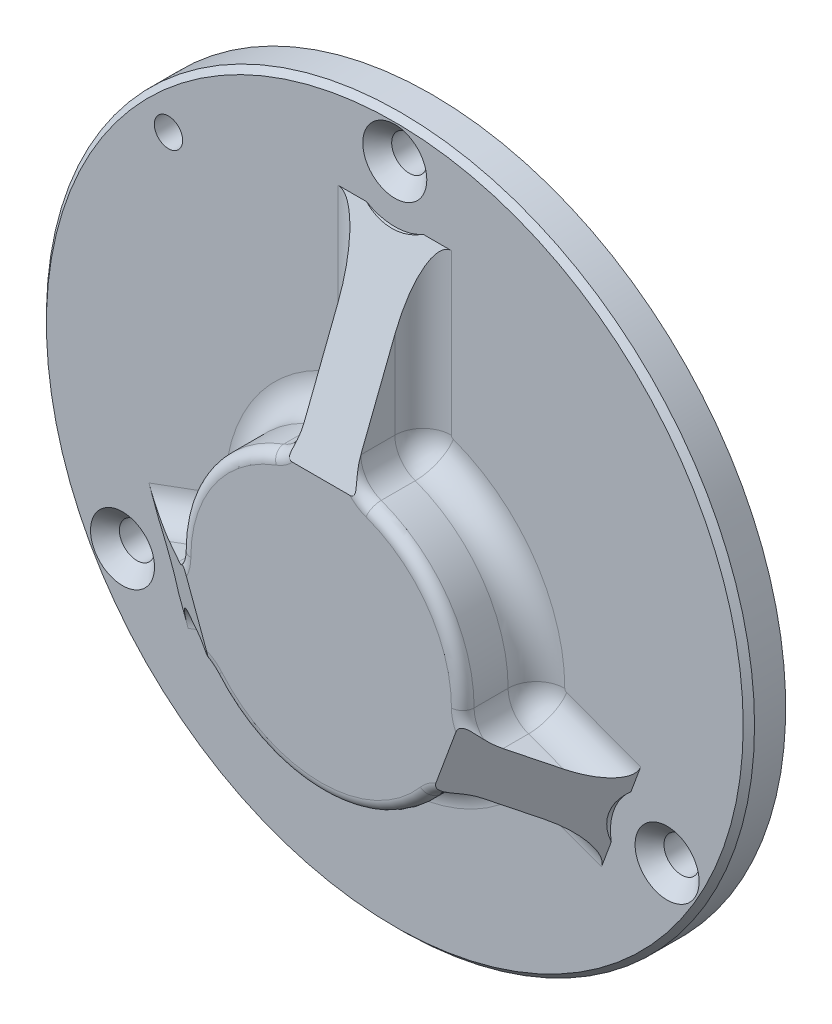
ISO-10303-21;
HEADER;
FILE_DESCRIPTION(('STEP AP214'),'2;1');
FILE_NAME('part.step','',(''),(''),'','','');
FILE_SCHEMA(('AUTOMOTIVE_DESIGN { 1 0 10303 214 1 1 1 1 }'));
ENDSEC;
DATA;
#1=APPLICATION_CONTEXT('core data for automotive mechanical design processes');
#2=APPLICATION_PROTOCOL_DEFINITION('international standard','automotive_design',2000,#1);
#3=PRODUCT_CONTEXT('',#1,'mechanical');
#4=PRODUCT('Part','Part','',(#3));
#5=PRODUCT_RELATED_PRODUCT_CATEGORY('part','',(#4));
#6=PRODUCT_DEFINITION_FORMATION('','',#4);
#7=PRODUCT_DEFINITION_CONTEXT('part definition',#1,'design');
#8=PRODUCT_DEFINITION('design','',#6,#7);
#9=PRODUCT_DEFINITION_SHAPE('','',#8);
#10=(LENGTH_UNIT() NAMED_UNIT(*) SI_UNIT(.MILLI.,.METRE.));
#11=(NAMED_UNIT(*) PLANE_ANGLE_UNIT() SI_UNIT($,.RADIAN.));
#12=(NAMED_UNIT(*) SI_UNIT($,.STERADIAN.) SOLID_ANGLE_UNIT());
#13=UNCERTAINTY_MEASURE_WITH_UNIT(LENGTH_MEASURE(1.E-05),#10,'distance_accuracy_value','');
#14=(GEOMETRIC_REPRESENTATION_CONTEXT(3) GLOBAL_UNCERTAINTY_ASSIGNED_CONTEXT((#13)) GLOBAL_UNIT_ASSIGNED_CONTEXT((#10,
#11,#12)) REPRESENTATION_CONTEXT('',''));
#15=CARTESIAN_POINT('',(0.,0.,0.));
#16=DIRECTION('',(0.,0.,1.));
#17=DIRECTION('',(1.,0.,0.));
#18=AXIS2_PLACEMENT_3D('',#15,#16,#17);
#19=CARTESIAN_POINT('',(0.,-10.,18.));
#20=DIRECTION('',(0.,0.,1.));
#21=DIRECTION('',(1.,0.,0.));
#22=AXIS2_PLACEMENT_3D('',#19,#20,#21);
#23=PLANE('',#22);
#24=CARTESIAN_POINT('',(23.2249301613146,-29.7699928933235,18.));
#25=DIRECTION('',(0.,0.,1.));
#26=DIRECTION('',(1.,0.,0.));
#27=AXIS2_PLACEMENT_3D('',#24,#25,#26);
#28=CIRCLE('',#27,7.5);
#29=CARTESIAN_POINT('',(17.5138817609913,-24.9085192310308,18.));
#30=VERTEX_POINT('',#29);
#31=CARTESIAN_POINT('',(20.2651850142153,-22.87870065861,18.));
#32=VERTEX_POINT('',#31);
#33=EDGE_CURVE('E272',#30,#32,#28,.F.);
#34=ORIENTED_EDGE('',*,*,#33,.T.);
#35=DIRECTION('',(-0.346428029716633,-0.938076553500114,0.));
#36=VECTOR('',#35,1.);
#37=CARTESIAN_POINT('',(31.7559690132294,8.23666566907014,18.));
#38=LINE('',#37,#36);
#39=CARTESIAN_POINT('',(23.7715764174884,-13.3839043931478,18.));
#40=VERTEX_POINT('',#39);
#41=EDGE_CURVE('E58',#40,#32,#38,.T.);
#42=ORIENTED_EDGE('',*,*,#41,.F.);
#43=CARTESIAN_POINT('',(30.4999187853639,-10.0703852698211,18.));
#44=DIRECTION('',(0.,0.,1.));
#45=DIRECTION('',(1.,0.,0.));
#46=AXIS2_PLACEMENT_3D('',#43,#44,#45);
#47=CIRCLE('',#46,7.5);
#48=CARTESIAN_POINT('',(22.999938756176,-10.0530774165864,18.));
#49=VERTEX_POINT('',#48);
#50=EDGE_CURVE('E269',#40,#49,#47,.F.);
#51=ORIENTED_EDGE('',*,*,#50,.T.);
#52=CARTESIAN_POINT('',(0.,-10.,18.));
#53=DIRECTION('',(0.,0.,1.));
#54=DIRECTION('',(1.,0.,0.));
#55=AXIS2_PLACEMENT_3D('',#52,#53,#54);
#56=CIRCLE('',#55,23.);
#57=CARTESIAN_POINT('',(7.91803278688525,11.5940907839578,18.));
#58=VERTEX_POINT('',#57);
#59=EDGE_CURVE('E288',#49,#58,#56,.T.);
#60=ORIENTED_EDGE('',*,*,#59,.T.);
#61=CARTESIAN_POINT('',(10.5,18.6356421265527,18.));
#62=DIRECTION('',(0.,0.,1.));
#63=DIRECTION('',(1.,0.,0.));
#64=AXIS2_PLACEMENT_3D('',#61,#62,#63);
#65=CIRCLE('',#64,7.5);
#66=CARTESIAN_POINT('',(5.06077901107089,13.4718378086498,18.));
#67=VERTEX_POINT('',#66);
#68=EDGE_CURVE('E292',#58,#67,#65,.F.);
#69=ORIENTED_EDGE('',*,*,#68,.T.);
#70=DIRECTION('',(1.,0.,0.));
#71=VECTOR('',#70,1.);
#72=CARTESIAN_POINT('',(-40.8108544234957,13.4718378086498,18.));
#73=LINE('',#72,#71);
#74=CARTESIAN_POINT('',(-5.06077901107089,13.4718378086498,18.));
#75=VERTEX_POINT('',#74);
#76=EDGE_CURVE('E558',#75,#67,#73,.T.);
#77=ORIENTED_EDGE('',*,*,#76,.F.);
#78=CARTESIAN_POINT('',(-10.5,18.6356421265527,18.));
#79=DIRECTION('',(0.,0.,1.));
#80=DIRECTION('',(1.,0.,0.));
#81=AXIS2_PLACEMENT_3D('',#78,#79,#80);
#82=CIRCLE('',#81,7.5);
#83=CARTESIAN_POINT('',(-7.91803278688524,11.5940907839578,18.));
#84=VERTEX_POINT('',#83);
#85=EDGE_CURVE('E483',#75,#84,#82,.F.);
#86=ORIENTED_EDGE('',*,*,#85,.T.);
#87=CARTESIAN_POINT('',(0.,-10.,18.));
#88=DIRECTION('',(0.,0.,1.));
#89=DIRECTION('',(1.,0.,0.));
#90=AXIS2_PLACEMENT_3D('',#87,#88,#89);
#91=CIRCLE('',#90,23.);
#92=CARTESIAN_POINT('',(-22.999938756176,-10.0530774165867,18.));
#93=VERTEX_POINT('',#92);
#94=EDGE_CURVE('E459',#84,#93,#91,.T.);
#95=ORIENTED_EDGE('',*,*,#94,.T.);
#96=CARTESIAN_POINT('',(-30.4999187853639,-10.0703852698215,18.));
#97=DIRECTION('',(0.,0.,1.));
#98=DIRECTION('',(1.,0.,0.));
#99=AXIS2_PLACEMENT_3D('',#96,#97,#98);
#100=CIRCLE('',#99,7.5);
#101=CARTESIAN_POINT('',(-23.7715764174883,-13.3839043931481,18.));
#102=VERTEX_POINT('',#101);
#103=EDGE_CURVE('E456',#93,#102,#100,.F.);
#104=ORIENTED_EDGE('',*,*,#103,.T.);
#105=DIRECTION('',(0.346428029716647,-0.938076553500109,0.));
#106=VECTOR('',#105,1.);
#107=CARTESIAN_POINT('',(-31.7559690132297,8.23666566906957,18.));
#108=LINE('',#107,#106);
#109=CARTESIAN_POINT('',(-20.265185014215,-22.8787006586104,17.9999999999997));
#110=VERTEX_POINT('',#109);
#111=EDGE_CURVE('E471',#102,#110,#108,.T.);
#112=ORIENTED_EDGE('',*,*,#111,.T.);
#113=CARTESIAN_POINT('',(-23.2249301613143,-29.7699928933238,18.));
#114=DIRECTION('',(0.,0.,1.));
#115=DIRECTION('',(1.,0.,0.));
#116=AXIS2_PLACEMENT_3D('',#113,#114,#115);
#117=CIRCLE('',#116,7.5);
#118=CARTESIAN_POINT('',(-17.5138817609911,-24.9085192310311,18.));
#119=VERTEX_POINT('',#118);
#120=EDGE_CURVE('E766',#110,#119,#117,.F.);
#121=ORIENTED_EDGE('',*,*,#120,.T.);
#122=CARTESIAN_POINT('',(0.,-10.,18.));
#123=DIRECTION('',(0.,0.,1.));
#124=DIRECTION('',(1.,0.,0.));
#125=AXIS2_PLACEMENT_3D('',#122,#123,#124);
#126=CIRCLE('',#125,23.);
#127=EDGE_CURVE('E579',#119,#30,#126,.T.);
#128=ORIENTED_EDGE('',*,*,#127,.T.);
#129=EDGE_LOOP('',(#34,#42,#51,#60,#69,#77,#86,#95,#104,#112,#121,#128));
#130=FACE_BOUND('',#129,.T.);
#131=ADVANCED_FACE('F37',(#130),#23,.T.);
#132=CARTESIAN_POINT('',(30.4999187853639,-10.0703852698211,16.));
#133=DIRECTION('',(0.,0.,1.));
#134=DIRECTION('',(1.,0.,0.));
#135=AXIS2_PLACEMENT_3D('',#132,#133,#134);
#136=TOROIDAL_SURFACE('',#135,7.5,2.);
#137=CARTESIAN_POINT('',(27.3754527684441,-14.7135288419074,15.3861796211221));
#138=CARTESIAN_POINT('',(27.3090586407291,-14.6462540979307,15.4444181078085));
#139=CARTESIAN_POINT('',(27.2423281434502,-14.5794132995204,15.5027690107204));
#140=CARTESIAN_POINT('',(27.1083972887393,-14.446341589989,15.6196269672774));
#141=CARTESIAN_POINT('',(27.0411969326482,-14.3801106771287,15.6781340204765));
#142=CARTESIAN_POINT('',(26.9064678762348,-14.2479405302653,15.7952889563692));
#143=CARTESIAN_POINT('',(26.8389389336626,-14.1820016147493,15.8539369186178));
#144=CARTESIAN_POINT('',(26.7036908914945,-14.0503758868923,15.971294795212));
#145=CARTESIAN_POINT('',(26.6359717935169,-13.9846890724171,16.0300047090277));
#146=CARTESIAN_POINT('',(26.4981237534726,-13.8514486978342,16.1494028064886));
#147=CARTESIAN_POINT('',(26.427988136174,-13.783903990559,16.2100931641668));
#148=CARTESIAN_POINT('',(26.2873666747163,-13.6492828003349,16.3315870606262));
#149=CARTESIAN_POINT('',(26.2168808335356,-13.5822063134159,16.3923905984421));
#150=CARTESIAN_POINT('',(26.0753000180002,-13.4489530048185,16.5141744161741));
#151=CARTESIAN_POINT('',(26.0042053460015,-13.3827757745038,16.5751545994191));
#152=CARTESIAN_POINT('',(25.860880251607,-13.2520009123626,16.6974675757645));
#153=CARTESIAN_POINT('',(25.7886499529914,-13.1874031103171,16.7588003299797));
#154=CARTESIAN_POINT('',(25.6666015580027,-13.0820840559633,16.8615315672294));
#155=CARTESIAN_POINT('',(25.6173295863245,-13.04057498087,16.902767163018));
#156=CARTESIAN_POINT('',(25.5175269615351,-12.9594071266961,16.9856056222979));
#157=CARTESIAN_POINT('',(25.4669958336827,-12.9197490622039,17.0272086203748));
#158=CARTESIAN_POINT('',(25.3645256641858,-12.8434230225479,17.1106084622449));
#159=CARTESIAN_POINT('',(25.3125968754,-12.8067385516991,17.152402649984));
#160=CARTESIAN_POINT('',(25.2064657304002,-12.7374794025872,17.236473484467));
#161=CARTESIAN_POINT('',(25.1522653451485,-12.704901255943,17.2787496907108));
#162=CARTESIAN_POINT('',(25.0515076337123,-12.6516690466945,17.3556126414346));
#163=CARTESIAN_POINT('',(25.0054766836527,-12.6299263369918,17.3901200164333));
#164=CARTESIAN_POINT('',(24.9109894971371,-12.5923135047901,17.4592985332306));
#165=CARTESIAN_POINT('',(24.8625299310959,-12.5764517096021,17.4939698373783));
#166=CARTESIAN_POINT('',(24.7623476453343,-12.552994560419,17.5634467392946));
#167=CARTESIAN_POINT('',(24.7105843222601,-12.5455396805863,17.5982451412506));
#168=CARTESIAN_POINT('',(24.6055430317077,-12.5427552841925,17.6659504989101));
#169=CARTESIAN_POINT('',(24.5522726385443,-12.5473731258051,17.6988650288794));
#170=CARTESIAN_POINT('',(24.4621645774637,-12.567467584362,17.7516452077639));
#171=CARTESIAN_POINT('',(24.4251014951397,-12.5793513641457,17.7725016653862));
#172=CARTESIAN_POINT('',(24.3525198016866,-12.6101543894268,17.8115702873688));
#173=CARTESIAN_POINT('',(24.3170014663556,-12.6290748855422,17.8297819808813));
#174=CARTESIAN_POINT('',(24.2486301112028,-12.6729866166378,17.8630730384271));
#175=CARTESIAN_POINT('',(24.2157661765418,-12.6979511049,17.8781656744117));
#176=CARTESIAN_POINT('',(24.1530029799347,-12.7527581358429,17.9053086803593));
#177=CARTESIAN_POINT('',(24.1231062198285,-12.7826047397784,17.9173564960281));
#178=CARTESIAN_POINT('',(24.0498855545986,-12.8644096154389,17.9448105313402));
#179=CARTESIAN_POINT('',(24.0088645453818,-12.9191325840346,17.9580950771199));
#180=CARTESIAN_POINT('',(23.9338801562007,-13.0342273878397,17.9788276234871));
#181=CARTESIAN_POINT('',(23.8999381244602,-13.0946155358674,17.9862581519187));
#182=CARTESIAN_POINT('',(23.8177362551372,-13.259961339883,17.999752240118));
#183=CARTESIAN_POINT('',(23.7748987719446,-13.3679293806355,18.0016450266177));
#184=CARTESIAN_POINT('',(23.7027765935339,-13.5879506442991,17.9958167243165));
#185=CARTESIAN_POINT('',(23.6735205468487,-13.7000119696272,17.9880754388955));
#186=CARTESIAN_POINT('',(23.630748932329,-13.9049370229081,17.9670709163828));
#187=CARTESIAN_POINT('',(23.6153298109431,-13.9975488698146,17.9550821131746));
#188=CARTESIAN_POINT('',(23.591309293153,-14.1830027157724,17.9266984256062));
#189=CARTESIAN_POINT('',(23.5827120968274,-14.2758448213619,17.9103008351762));
#190=CARTESIAN_POINT('',(23.5662627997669,-14.5540005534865,17.8552321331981));
#191=CARTESIAN_POINT('',(23.5677851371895,-14.7387764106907,17.8107039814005));
#192=CARTESIAN_POINT('',(23.5912752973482,-15.0804110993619,17.7151778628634));
#193=CARTESIAN_POINT('',(23.6106848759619,-15.2378908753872,17.6656664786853));
#194=CARTESIAN_POINT('',(23.6513870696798,-15.4692013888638,17.5851599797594));
#195=CARTESIAN_POINT('',(23.6668137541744,-15.5452359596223,17.5573896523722));
#196=CARTESIAN_POINT('',(23.7013867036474,-15.6956874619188,17.49985606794));
#197=CARTESIAN_POINT('',(23.7205328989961,-15.7701044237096,17.470092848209));
#198=CARTESIAN_POINT('',(23.7414785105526,-15.8436266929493,17.439391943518));
#199=B_SPLINE_CURVE_WITH_KNOTS('',3,(#137,#138,#139,#140,#141,#142,#143,#144,#145,#146,#147,
#148,#149,#150,#151,#152,#153,#154,#155,#156,#157,#158,#159,#160,#161,#162,#163,#164,#165,#166,
#167,#168,#169,#170,#171,#172,#173,#174,#175,#176,#177,#178,#179,#180,#181,#182,#183,#184,#185,
#186,#187,#188,#189,#190,#191,#192,#193,#194,#195,#196,#197,#198),.UNSPECIFIED.,.F.,.F.,(4,2,2,
2,2,2,2,2,2,2,2,2,2,2,2,2,2,2,2,2,2,2,2,2,2,2,2,2,2,2,4),(0.,0.333059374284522,0.66611779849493,
0.999477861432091,1.3328350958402,1.67704588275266,2.02125374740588,2.36529958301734,
2.70930817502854,2.93876401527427,3.16830771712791,3.39647572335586,3.62444969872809,
3.80872546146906,3.99326116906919,4.18083666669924,4.36759562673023,4.49943081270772,
4.63128944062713,4.76257488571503,4.89397010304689,5.10178039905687,5.310208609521,
5.65679208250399,6.00410334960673,6.28766268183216,6.57139645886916,7.13937200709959,
7.63692959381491,7.88403066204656,8.13112710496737),.UNSPECIFIED.);
#200=CARTESIAN_POINT('',(26.6705649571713,-14.0183023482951,16.));
#201=VERTEX_POINT('',#200);
#202=EDGE_CURVE('E276',#201,#40,#199,.T.);
#203=ORIENTED_EDGE('',*,*,#202,.F.);
#204=CARTESIAN_POINT('',(30.4999187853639,-10.0703852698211,16.));
#205=DIRECTION('',(0.,0.,1.));
#206=DIRECTION('',(1.,0.,0.));
#207=AXIS2_PLACEMENT_3D('',#204,#205,#206);
#208=CIRCLE('',#207,5.5);
#209=CARTESIAN_POINT('',(24.9999334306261,-10.0576928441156,16.));
#210=VERTEX_POINT('',#209);
#211=EDGE_CURVE('E287',#210,#201,#208,.T.);
#212=ORIENTED_EDGE('',*,*,#211,.F.);
#213=CARTESIAN_POINT('',(22.999938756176,-10.0530774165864,16.));
#214=DIRECTION('',(-0.00230771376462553,-0.999997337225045,0.));
#215=DIRECTION('',(0.999997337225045,-0.00230771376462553,0.));
#216=AXIS2_PLACEMENT_3D('',#213,#214,#215);
#217=CIRCLE('',#216,2.);
#218=EDGE_CURVE('E285',#210,#49,#217,.T.);
#219=ORIENTED_EDGE('',*,*,#218,.T.);
#220=ORIENTED_EDGE('',*,*,#50,.F.);
#221=EDGE_LOOP('',(#203,#212,#219,#220));
#222=FACE_BOUND('',#221,.T.);
#223=ADVANCED_FACE('F283',(#222),#136,.T.);
#224=CARTESIAN_POINT('',(-23.2249301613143,-29.7699928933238,16.));
#225=DIRECTION('',(0.,0.,1.));
#226=DIRECTION('',(1.,0.,0.));
#227=AXIS2_PLACEMENT_3D('',#224,#225,#226);
#228=TOROIDAL_SURFACE('',#227,7.5,2.);
#229=CARTESIAN_POINT('',(-23.86823391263,-24.2105657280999,15.3861796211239));
#230=CARTESIAN_POINT('',(-23.7676667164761,-24.2190735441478,15.4483672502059));
#231=CARTESIAN_POINT('',(-23.6671294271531,-24.2269653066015,15.5106810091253));
#232=CARTESIAN_POINT('',(-23.4660977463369,-24.2418986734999,15.6354815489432));
#233=CARTESIAN_POINT('',(-23.3656033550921,-24.2489402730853,15.6979683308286));
#234=CARTESIAN_POINT('',(-23.1645179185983,-24.2625635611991,15.8231120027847));
#235=CARTESIAN_POINT('',(-23.0639269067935,-24.2691446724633,15.8857690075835));
#236=CARTESIAN_POINT('',(-22.8627670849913,-24.2819592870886,16.011150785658));
#237=CARTESIAN_POINT('',(-22.7621982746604,-24.2881927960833,16.0738755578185));
#238=CARTESIAN_POINT('',(-22.5625851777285,-24.3001491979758,16.1984723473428));
#239=CARTESIAN_POINT('',(-22.4635405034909,-24.3058783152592,16.2603431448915));
#240=CARTESIAN_POINT('',(-22.2654991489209,-24.3166189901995,16.3842232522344));
#241=CARTESIAN_POINT('',(-22.1665024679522,-24.3216305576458,16.4462325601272));
#242=CARTESIAN_POINT('',(-21.9686624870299,-24.3303098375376,16.5704700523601));
#243=CARTESIAN_POINT('',(-21.8698191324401,-24.3339782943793,16.6326980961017));
#244=CARTESIAN_POINT('',(-21.6723490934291,-24.3389017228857,16.7575848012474));
#245=CARTESIAN_POINT('',(-21.573722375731,-24.3401570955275,16.8202433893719));
#246=CARTESIAN_POINT('',(-21.435367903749,-24.3388997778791,16.9088529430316));
#247=CARTESIAN_POINT('',(-21.3954392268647,-24.3381818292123,16.9345090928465));
#248=CARTESIAN_POINT('',(-21.3156992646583,-24.3358363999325,16.9859608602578));
#249=CARTESIAN_POINT('',(-21.2758879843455,-24.3342088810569,17.0117564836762));
#250=CARTESIAN_POINT('',(-21.156042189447,-24.3276120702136,17.0898104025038));
#251=CARTESIAN_POINT('',(-21.0762384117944,-24.3209275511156,17.1423257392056));
#252=CARTESIAN_POINT('',(-20.9479549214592,-24.3041631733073,17.2281622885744));
#253=CARTESIAN_POINT('',(-20.8990293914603,-24.2963195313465,17.2612409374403));
#254=CARTESIAN_POINT('',(-20.8020756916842,-24.2767826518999,17.3277328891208));
#255=CARTESIAN_POINT('',(-20.7540484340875,-24.2650857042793,17.3611464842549));
#256=CARTESIAN_POINT('',(-20.6601072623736,-24.2366575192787,17.4278114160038));
#257=CARTESIAN_POINT('',(-20.6141768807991,-24.2199784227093,17.461060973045));
#258=CARTESIAN_POINT('',(-20.525184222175,-24.1799023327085,17.5273129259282));
#259=CARTESIAN_POINT('',(-20.4821157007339,-24.1565205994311,17.5603157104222));
#260=CARTESIAN_POINT('',(-20.4090435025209,-24.1069075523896,17.6186535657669));
#261=CARTESIAN_POINT('',(-20.378164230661,-24.0822231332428,17.6441828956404));
#262=CARTESIAN_POINT('',(-20.3208401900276,-24.0269189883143,17.6938100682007));
#263=CARTESIAN_POINT('',(-20.2943919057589,-23.9963040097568,17.7179090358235));
#264=CARTESIAN_POINT('',(-20.2471534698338,-23.9290892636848,17.7639060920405));
#265=CARTESIAN_POINT('',(-20.2264030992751,-23.8924501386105,17.7857880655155));
#266=CARTESIAN_POINT('',(-20.1916658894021,-23.8144732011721,17.8263423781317));
#267=CARTESIAN_POINT('',(-20.1776829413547,-23.773132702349,17.8450128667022));
#268=CARTESIAN_POINT('',(-20.1572855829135,-23.6908225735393,17.8774353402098));
#269=CARTESIAN_POINT('',(-20.150360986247,-23.6500811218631,17.8914591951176));
#270=CARTESIAN_POINT('',(-20.1416631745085,-23.5671953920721,17.9165494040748));
#271=CARTESIAN_POINT('',(-20.1398916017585,-23.5250506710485,17.927614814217));
#272=CARTESIAN_POINT('',(-20.141085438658,-23.4112228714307,17.9536849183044));
#273=CARTESIAN_POINT('',(-20.1481121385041,-23.3390232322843,17.9662190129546));
#274=CARTESIAN_POINT('',(-20.1715760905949,-23.195297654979,17.9851215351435));
#275=CARTESIAN_POINT('',(-20.1880470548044,-23.1237750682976,17.9914676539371));
#276=CARTESIAN_POINT('',(-20.2249135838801,-22.9939058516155,17.9985488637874));
#277=CARTESIAN_POINT('',(-20.2442533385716,-22.9352886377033,18.0000216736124));
#278=CARTESIAN_POINT('',(-20.2870581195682,-22.8195654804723,17.9999778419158));
#279=CARTESIAN_POINT('',(-20.3105262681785,-22.7624607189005,17.9984589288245));
#280=CARTESIAN_POINT('',(-20.3860581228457,-22.5936733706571,17.9900336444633));
#281=CARTESIAN_POINT('',(-20.4432740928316,-22.4844368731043,17.9792619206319));
#282=CARTESIAN_POINT('',(-20.5203270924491,-22.3537145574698,17.9608927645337));
#283=CARTESIAN_POINT('',(-20.5354790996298,-22.3287043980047,17.9571166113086));
#284=CARTESIAN_POINT('',(-20.5662891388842,-22.279166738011,17.9491275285));
#285=CARTESIAN_POINT('',(-20.5819456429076,-22.2546380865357,17.9449158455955));
#286=CARTESIAN_POINT('',(-20.5978656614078,-22.2303081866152,17.9404891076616));
#287=B_SPLINE_CURVE_WITH_KNOTS('',3,(#229,#230,#231,#232,#233,#234,#235,#236,#237,#238,#239,
#240,#241,#242,#243,#244,#245,#246,#247,#248,#249,#250,#251,#252,#253,#254,#255,#256,#257,#258,
#259,#260,#261,#262,#263,#264,#265,#266,#267,#268,#269,#270,#271,#272,#273,#274,#275,#276,#277,
#278,#279,#280,#281,#282,#283,#284,#285,#286),.UNSPECIFIED.,.F.,.F.,(4,2,2,2,2,2,2,2,2,2,2,2,2,
2,2,2,2,2,2,2,2,2,2,2,2,2,2,2,4),(0.,0.35563521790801,0.711272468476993,1.06734783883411,
1.42341743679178,1.77418148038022,2.12494073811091,2.47550529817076,2.82601160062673,
2.96840137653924,3.11079714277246,3.397874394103,3.57651571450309,3.755329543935,
3.93233391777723,4.10893845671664,4.24962233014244,4.39019405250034,4.53172359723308,
4.67333442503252,4.80377016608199,4.93424747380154,5.15383188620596,5.37420504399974,
5.55916967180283,5.74427479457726,6.11423375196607,6.20268798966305,6.29089569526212),.UNSPECIFIED.);
#288=CARTESIAN_POINT('',(-22.8806727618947,-24.2807773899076,16.));
#289=VERTEX_POINT('',#288);
#290=EDGE_CURVE('E443',#289,#110,#287,.T.);
#291=ORIENTED_EDGE('',*,*,#290,.F.);
#292=CARTESIAN_POINT('',(-23.2249301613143,-29.7699928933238,16.));
#293=DIRECTION('',(0.,0.,1.));
#294=DIRECTION('',(1.,0.,0.));
#295=AXIS2_PLACEMENT_3D('',#292,#293,#294);
#296=CIRCLE('',#295,5.5);
#297=CARTESIAN_POINT('',(-19.0368280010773,-26.2049122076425,16.));
#298=VERTEX_POINT('',#297);
#299=EDGE_CURVE('E306',#298,#289,#296,.T.);
#300=ORIENTED_EDGE('',*,*,#299,.F.);
#301=CARTESIAN_POINT('',(-17.5138817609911,-24.9085192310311,16.));
#302=DIRECTION('',(0.648196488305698,-0.761473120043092,0.));
#303=DIRECTION('',(0.761473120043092,0.648196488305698,0.));
#304=AXIS2_PLACEMENT_3D('',#301,#302,#303);
#305=CIRCLE('',#304,2.);
#306=EDGE_CURVE('E318',#119,#298,#305,.T.);
#307=ORIENTED_EDGE('',*,*,#306,.F.);
#308=ORIENTED_EDGE('',*,*,#120,.F.);
#309=EDGE_LOOP('',(#291,#300,#307,#308));
#310=FACE_BOUND('',#309,.T.);
#311=ADVANCED_FACE('F531',(#310),#228,.T.);
#312=CARTESIAN_POINT('',(0.,0.,5.));
#313=DIRECTION('',(0.,0.,1.));
#314=DIRECTION('',(1.,0.,0.));
#315=AXIS2_PLACEMENT_3D('',#312,#313,#314);
#316=PLANE('',#315);
#317=CARTESIAN_POINT('',(0.,0.,5.));
#318=DIRECTION('',(0.,0.,1.));
#319=DIRECTION('',(1.,0.,0.));
#320=AXIS2_PLACEMENT_3D('',#317,#318,#319);
#321=CIRCLE('',#320,61.5);
#322=CARTESIAN_POINT('',(61.5,0.,5.));
#323=VERTEX_POINT('',#322);
#324=EDGE_CURVE('E589',#323,#323,#321,.T.);
#325=ORIENTED_EDGE('',*,*,#324,.T.);
#326=EDGE_LOOP('',(#325));
#327=FACE_BOUND('',#326,.T.);
#328=CARTESIAN_POINT('',(-48.0644099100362,-27.7500000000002,5.));
#329=DIRECTION('',(0.,0.,-1.));
#330=DIRECTION('',(1.,0.,0.));
#331=AXIS2_PLACEMENT_3D('',#328,#329,#330);
#332=CIRCLE('',#331,10.);
#333=CARTESIAN_POINT('',(-41.672568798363,-20.0594624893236,5.));
#334=VERTEX_POINT('',#333);
#335=CARTESIAN_POINT('',(-38.2082885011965,-29.4402280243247,5.));
#336=VERTEX_POINT('',#335);
#337=EDGE_CURVE('E820',#334,#336,#332,.T.);
#338=ORIENTED_EDGE('',*,*,#337,.F.);
#339=DIRECTION('',(-0.346428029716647,0.938076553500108,0.));
#340=VECTOR('',#339,1.);
#341=CARTESIAN_POINT('',(-43.190188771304,-15.9499690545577,5.));
#342=LINE('',#341,#340);
#343=CARTESIAN_POINT('',(-43.4047089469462,-15.3690797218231,5.));
#344=VERTEX_POINT('',#343);
#345=EDGE_CURVE('E428',#334,#344,#342,.T.);
#346=ORIENTED_EDGE('',*,*,#345,.T.);
#347=DIRECTION('',(-0.938076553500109,-0.346428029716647,0.));
#348=VECTOR('',#347,1.);
#349=CARTESIAN_POINT('',(-0.214520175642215,0.580889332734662,5.));
#350=LINE('',#349,#348);
#351=CARTESIAN_POINT('',(-30.3267047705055,-10.5394235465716,5.));
#352=VERTEX_POINT('',#351);
#353=EDGE_CURVE('E426',#344,#352,#350,.F.);
#354=ORIENTED_EDGE('',*,*,#353,.T.);
#355=CARTESIAN_POINT('',(-30.4999187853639,-10.0703852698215,5.));
#356=DIRECTION('',(0.,0.,1.));
#357=DIRECTION('',(1.,0.,0.));
#358=AXIS2_PLACEMENT_3D('',#355,#356,#357);
#359=CIRCLE('',#358,0.5);
#360=CARTESIAN_POINT('',(-29.9999201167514,-10.0692314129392,5.));
#361=VERTEX_POINT('',#360);
#362=EDGE_CURVE('E424',#352,#361,#359,.T.);
#363=ORIENTED_EDGE('',*,*,#362,.T.);
#364=CARTESIAN_POINT('',(0.,-10.,5.));
#365=DIRECTION('',(0.,0.,1.));
#366=DIRECTION('',(1.,0.,0.));
#367=AXIS2_PLACEMENT_3D('',#364,#365,#366);
#368=CIRCLE('',#367,30.);
#369=CARTESIAN_POINT('',(-10.327868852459,18.1662053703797,5.));
#370=VERTEX_POINT('',#369);
#371=EDGE_CURVE('E422',#361,#370,#368,.F.);
#372=ORIENTED_EDGE('',*,*,#371,.T.);
#373=CARTESIAN_POINT('',(-10.5,18.6356421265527,5.));
#374=DIRECTION('',(0.,0.,1.));
#375=DIRECTION('',(1.,0.,0.));
#376=AXIS2_PLACEMENT_3D('',#373,#374,#375);
#377=CIRCLE('',#376,0.5);
#378=CARTESIAN_POINT('',(-10.,18.6356421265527,5.));
#379=VERTEX_POINT('',#378);
#380=EDGE_CURVE('E420',#370,#379,#377,.T.);
#381=ORIENTED_EDGE('',*,*,#380,.T.);
#382=DIRECTION('',(0.,-1.,0.));
#383=VECTOR('',#382,1.);
#384=CARTESIAN_POINT('',(-9.99999999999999,0.,5.));
#385=LINE('',#384,#383);
#386=CARTESIAN_POINT('',(-10.,46.8397459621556,5.));
#387=VERTEX_POINT('',#386);
#388=EDGE_CURVE('E417',#379,#387,#385,.F.);
#389=ORIENTED_EDGE('',*,*,#388,.T.);
#390=DIRECTION('',(1.,0.,0.));
#391=VECTOR('',#390,1.);
#392=CARTESIAN_POINT('',(0.,46.8397459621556,5.));
#393=LINE('',#392,#391);
#394=CARTESIAN_POINT('',(-5.,46.8397459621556,5.));
#395=VERTEX_POINT('',#394);
#396=EDGE_CURVE('E415',#387,#395,#393,.T.);
#397=ORIENTED_EDGE('',*,*,#396,.T.);
#398=CARTESIAN_POINT('',(0.,55.5,5.));
#399=DIRECTION('',(0.,0.,-1.));
#400=DIRECTION('',(1.,0.,0.));
#401=AXIS2_PLACEMENT_3D('',#398,#399,#400);
#402=CIRCLE('',#401,10.);
#403=CARTESIAN_POINT('',(5.,46.8397459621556,5.));
#404=VERTEX_POINT('',#403);
#405=EDGE_CURVE('E823',#404,#395,#402,.T.);
#406=ORIENTED_EDGE('',*,*,#405,.F.);
#407=DIRECTION('',(1.,0.,0.));
#408=VECTOR('',#407,1.);
#409=CARTESIAN_POINT('',(0.,46.8397459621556,5.));
#410=LINE('',#409,#408);
#411=CARTESIAN_POINT('',(10.,46.8397459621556,5.));
#412=VERTEX_POINT('',#411);
#413=EDGE_CURVE('E385',#404,#412,#410,.T.);
#414=ORIENTED_EDGE('',*,*,#413,.T.);
#415=DIRECTION('',(0.,1.,0.));
#416=VECTOR('',#415,1.);
#417=CARTESIAN_POINT('',(10.,0.,5.));
#418=LINE('',#417,#416);
#419=CARTESIAN_POINT('',(10.,18.6356421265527,5.));
#420=VERTEX_POINT('',#419);
#421=EDGE_CURVE('E383',#412,#420,#418,.F.);
#422=ORIENTED_EDGE('',*,*,#421,.T.);
#423=CARTESIAN_POINT('',(10.5,18.6356421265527,5.));
#424=DIRECTION('',(0.,0.,1.));
#425=DIRECTION('',(1.,0.,0.));
#426=AXIS2_PLACEMENT_3D('',#423,#424,#425);
#427=CIRCLE('',#426,0.5);
#428=CARTESIAN_POINT('',(10.327868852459,18.1662053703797,5.));
#429=VERTEX_POINT('',#428);
#430=EDGE_CURVE('E381',#420,#429,#427,.T.);
#431=ORIENTED_EDGE('',*,*,#430,.T.);
#432=CARTESIAN_POINT('',(0.,-10.,5.));
#433=DIRECTION('',(0.,0.,1.));
#434=DIRECTION('',(1.,0.,0.));
#435=AXIS2_PLACEMENT_3D('',#432,#433,#434);
#436=CIRCLE('',#435,30.);
#437=CARTESIAN_POINT('',(29.9999201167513,-10.0692314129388,5.));
#438=VERTEX_POINT('',#437);
#439=EDGE_CURVE('E379',#429,#438,#436,.F.);
#440=ORIENTED_EDGE('',*,*,#439,.T.);
#441=CARTESIAN_POINT('',(30.4999187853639,-10.0703852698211,5.));
#442=DIRECTION('',(0.,0.,1.));
#443=DIRECTION('',(1.,0.,0.));
#444=AXIS2_PLACEMENT_3D('',#441,#442,#443);
#445=CIRCLE('',#444,0.5);
#446=CARTESIAN_POINT('',(30.3267047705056,-10.5394235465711,5.));
#447=VERTEX_POINT('',#446);
#448=EDGE_CURVE('E377',#438,#447,#445,.T.);
#449=ORIENTED_EDGE('',*,*,#448,.T.);
#450=DIRECTION('',(-0.938076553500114,0.346428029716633,0.));
#451=VECTOR('',#450,1.);
#452=CARTESIAN_POINT('',(0.214520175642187,0.580889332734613,5.));
#453=LINE('',#452,#451);
#454=CARTESIAN_POINT('',(43.4047089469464,-15.3690797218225,5.));
#455=VERTEX_POINT('',#454);
#456=EDGE_CURVE('E374',#447,#455,#453,.F.);
#457=ORIENTED_EDGE('',*,*,#456,.T.);
#458=DIRECTION('',(-0.346428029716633,-0.938076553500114,0.));
#459=VECTOR('',#458,1.);
#460=CARTESIAN_POINT('',(43.1901887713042,-15.9499690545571,5.));
#461=LINE('',#460,#459);
#462=CARTESIAN_POINT('',(41.6725687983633,-20.059462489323,5.));
#463=VERTEX_POINT('',#462);
#464=EDGE_CURVE('E372',#455,#463,#461,.T.);
#465=ORIENTED_EDGE('',*,*,#464,.T.);
#466=CARTESIAN_POINT('',(48.0644099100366,-27.7499999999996,5.));
#467=DIRECTION('',(0.,0.,-1.));
#468=DIRECTION('',(1.,0.,0.));
#469=AXIS2_PLACEMENT_3D('',#466,#467,#468);
#470=CIRCLE('',#469,10.);
#471=CARTESIAN_POINT('',(38.2082885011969,-29.4402280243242,5.));
#472=VERTEX_POINT('',#471);
#473=EDGE_CURVE('E826',#472,#463,#470,.T.);
#474=ORIENTED_EDGE('',*,*,#473,.F.);
#475=DIRECTION('',(-0.346428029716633,-0.938076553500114,0.));
#476=VECTOR('',#475,1.);
#477=CARTESIAN_POINT('',(43.1901887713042,-15.9499690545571,5.));
#478=LINE('',#477,#476);
#479=CARTESIAN_POINT('',(36.4761483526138,-34.1306107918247,5.));
#480=VERTEX_POINT('',#479);
#481=EDGE_CURVE('E342',#472,#480,#478,.T.);
#482=ORIENTED_EDGE('',*,*,#481,.T.);
#483=DIRECTION('',(0.938076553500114,-0.346428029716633,0.));
#484=VECTOR('',#483,1.);
#485=CARTESIAN_POINT('',(-6.71404041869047,-18.1806417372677,5.));
#486=LINE('',#485,#484);
#487=CARTESIAN_POINT('',(23.3981441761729,-29.3009546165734,5.));
#488=VERTEX_POINT('',#487);
#489=EDGE_CURVE('E340',#480,#488,#486,.F.);
#490=ORIENTED_EDGE('',*,*,#489,.T.);
#491=CARTESIAN_POINT('',(23.2249301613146,-29.7699928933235,5.));
#492=DIRECTION('',(0.,0.,1.));
#493=DIRECTION('',(1.,0.,0.));
#494=AXIS2_PLACEMENT_3D('',#491,#492,#493);
#495=CIRCLE('',#494,0.5);
#496=CARTESIAN_POINT('',(22.844193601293,-29.4458946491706,5.));
#497=VERTEX_POINT('',#496);
#498=EDGE_CURVE('E338',#488,#497,#495,.T.);
#499=ORIENTED_EDGE('',*,*,#498,.T.);
#500=CARTESIAN_POINT('',(0.,-10.,5.));
#501=DIRECTION('',(0.,0.,1.));
#502=DIRECTION('',(1.,0.,0.));
#503=AXIS2_PLACEMENT_3D('',#500,#501,#502);
#504=CIRCLE('',#503,30.);
#505=CARTESIAN_POINT('',(-22.8441936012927,-29.445894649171,5.));
#506=VERTEX_POINT('',#505);
#507=EDGE_CURVE('E336',#497,#506,#504,.F.);
#508=ORIENTED_EDGE('',*,*,#507,.T.);
#509=CARTESIAN_POINT('',(-23.2249301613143,-29.7699928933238,5.));
#510=DIRECTION('',(0.,0.,1.));
#511=DIRECTION('',(1.,0.,0.));
#512=AXIS2_PLACEMENT_3D('',#509,#510,#511);
#513=CIRCLE('',#512,0.5);
#514=CARTESIAN_POINT('',(-23.3981441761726,-29.3009546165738,5.));
#515=VERTEX_POINT('',#514);
#516=EDGE_CURVE('E334',#506,#515,#513,.T.);
#517=ORIENTED_EDGE('',*,*,#516,.T.);
#518=DIRECTION('',(0.938076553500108,0.346428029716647,0.));
#519=VECTOR('',#518,1.);
#520=CARTESIAN_POINT('',(6.71404041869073,-18.1806417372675,5.));
#521=LINE('',#520,#519);
#522=CARTESIAN_POINT('',(-36.4761483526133,-34.1306107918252,5.));
#523=VERTEX_POINT('',#522);
#524=EDGE_CURVE('E331',#515,#523,#521,.F.);
#525=ORIENTED_EDGE('',*,*,#524,.T.);
#526=DIRECTION('',(-0.346428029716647,0.938076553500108,0.));
#527=VECTOR('',#526,1.);
#528=CARTESIAN_POINT('',(-43.190188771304,-15.9499690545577,5.));
#529=LINE('',#528,#527);
#530=EDGE_CURVE('E329',#523,#336,#529,.T.);
#531=ORIENTED_EDGE('',*,*,#530,.T.);
#532=EDGE_LOOP('',(#338,#346,#354,#363,#372,#381,#389,#397,#406,#414,#422,#431,#440,#449,#457,
#465,#474,#482,#490,#499,#508,#517,#525,#531));
#533=FACE_BOUND('',#532,.T.);
#534=CARTESIAN_POINT('',(0.,55.5,5.));
#535=DIRECTION('',(0.,0.,1.));
#536=DIRECTION('',(1.,0.,0.));
#537=AXIS2_PLACEMENT_3D('',#534,#535,#536);
#538=CIRCLE('',#537,5.64999999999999);
#539=CARTESIAN_POINT('',(5.64999999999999,55.5,5.));
#540=VERTEX_POINT('',#539);
#541=EDGE_CURVE('E858',#540,#540,#538,.F.);
#542=ORIENTED_EDGE('',*,*,#541,.T.);
#543=EDGE_LOOP('',(#542));
#544=FACE_BOUND('',#543,.T.);
#545=CARTESIAN_POINT('',(-48.0644099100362,-27.7500000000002,5.));
#546=DIRECTION('',(0.,0.,1.));
#547=DIRECTION('',(1.,0.,0.));
#548=AXIS2_PLACEMENT_3D('',#545,#546,#547);
#549=CIRCLE('',#548,5.64999999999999);
#550=CARTESIAN_POINT('',(-42.4144099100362,-27.7500000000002,5.));
#551=VERTEX_POINT('',#550);
#552=EDGE_CURVE('E864',#551,#551,#549,.F.);
#553=ORIENTED_EDGE('',*,*,#552,.T.);
#554=EDGE_LOOP('',(#553));
#555=FACE_BOUND('',#554,.T.);
#556=CARTESIAN_POINT('',(48.0644099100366,-27.7499999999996,5.));
#557=DIRECTION('',(0.,0.,1.));
#558=DIRECTION('',(1.,0.,0.));
#559=AXIS2_PLACEMENT_3D('',#556,#557,#558);
#560=CIRCLE('',#559,5.64999999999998);
#561=CARTESIAN_POINT('',(53.7144099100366,-27.7499999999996,5.));
#562=VERTEX_POINT('',#561);
#563=EDGE_CURVE('E870',#562,#562,#560,.F.);
#564=ORIENTED_EDGE('',*,*,#563,.T.);
#565=EDGE_LOOP('',(#564));
#566=FACE_BOUND('',#565,.T.);
#567=CARTESIAN_POINT('',(-39.95153313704,39.9515331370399,5.));
#568=DIRECTION('',(0.,0.,1.));
#569=DIRECTION('',(1.,0.,0.));
#570=AXIS2_PLACEMENT_3D('',#567,#568,#569);
#571=CIRCLE('',#570,2.5);
#572=CARTESIAN_POINT('',(-37.45153313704,39.9515331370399,5.));
#573=VERTEX_POINT('',#572);
#574=EDGE_CURVE('E832',#573,#573,#571,.F.);
#575=ORIENTED_EDGE('',*,*,#574,.T.);
#576=EDGE_LOOP('',(#575));
#577=FACE_BOUND('',#576,.T.);
#578=ADVANCED_FACE('F605',(#327,#533,#544,#555,#566,#577),#316,.T.);
#579=CARTESIAN_POINT('',(0.,-10.,18.));
#580=DIRECTION('',(0.,0.,-1.));
#581=DIRECTION('',(-1.,0.,0.));
#582=AXIS2_PLACEMENT_3D('',#579,#580,#581);
#583=CYLINDRICAL_SURFACE('',#582,25.);
#584=DIRECTION('',(0.,0.,-1.));
#585=VECTOR('',#584,1.);
#586=CARTESIAN_POINT('',(-19.0368280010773,-26.2049122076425,18.));
#587=LINE('',#586,#585);
#588=CARTESIAN_POINT('',(-19.0368280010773,-26.2049122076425,9.99999999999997));
#589=VERTEX_POINT('',#588);
#590=EDGE_CURVE('E751',#298,#589,#587,.T.);
#591=ORIENTED_EDGE('',*,*,#590,.T.);
#592=CARTESIAN_POINT('',(0.,-10.,10.));
#593=DIRECTION('',(0.,0.,1.));
#594=DIRECTION('',(1.,0.,0.));
#595=AXIS2_PLACEMENT_3D('',#592,#593,#594);
#596=CIRCLE('',#595,25.);
#597=CARTESIAN_POINT('',(19.0368280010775,-26.2049122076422,10.));
#598=VERTEX_POINT('',#597);
#599=EDGE_CURVE('E347',#589,#598,#596,.T.);
#600=ORIENTED_EDGE('',*,*,#599,.T.);
#601=DIRECTION('',(0.,0.,-1.));
#602=VECTOR('',#601,1.);
#603=CARTESIAN_POINT('',(19.0368280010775,-26.2049122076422,18.));
#604=LINE('',#603,#602);
#605=CARTESIAN_POINT('',(19.0368280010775,-26.2049122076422,16.));
#606=VERTEX_POINT('',#605);
#607=EDGE_CURVE('E755',#598,#606,#604,.F.);
#608=ORIENTED_EDGE('',*,*,#607,.T.);
#609=CARTESIAN_POINT('',(0.,-10.,16.));
#610=DIRECTION('',(0.,0.,1.));
#611=DIRECTION('',(1.,0.,0.));
#612=AXIS2_PLACEMENT_3D('',#609,#610,#611);
#613=CIRCLE('',#612,25.);
#614=EDGE_CURVE('E301',#606,#298,#613,.F.);
#615=ORIENTED_EDGE('',*,*,#614,.T.);
#616=EDGE_LOOP('',(#591,#600,#608,#615));
#617=FACE_BOUND('',#616,.T.);
#618=ADVANCED_FACE('F686',(#617),#583,.T.);
#619=DIRECTION('',(0.,0.,-1.));
#620=VECTOR('',#619,1.);
#621=CARTESIAN_POINT('',(-8.60655737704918,13.4718378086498,18.));
#622=LINE('',#621,#620);
#623=CARTESIAN_POINT('',(-8.60655737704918,13.4718378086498,16.));
#624=VERTEX_POINT('',#623);
#625=CARTESIAN_POINT('',(-8.60655737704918,13.4718378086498,9.99999999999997));
#626=VERTEX_POINT('',#625);
#627=EDGE_CURVE('E567',#624,#626,#622,.T.);
#628=ORIENTED_EDGE('',*,*,#627,.T.);
#629=CARTESIAN_POINT('',(0.,-10.,10.));
#630=DIRECTION('',(0.,0.,1.));
#631=DIRECTION('',(1.,0.,0.));
#632=AXIS2_PLACEMENT_3D('',#629,#630,#631);
#633=CIRCLE('',#632,25.);
#634=CARTESIAN_POINT('',(-24.9999334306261,-10.057692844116,10.));
#635=VERTEX_POINT('',#634);
#636=EDGE_CURVE('E433',#626,#635,#633,.T.);
#637=ORIENTED_EDGE('',*,*,#636,.T.);
#638=DIRECTION('',(0.,0.,-1.));
#639=VECTOR('',#638,1.);
#640=CARTESIAN_POINT('',(-24.9999334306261,-10.057692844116,18.));
#641=LINE('',#640,#639);
#642=CARTESIAN_POINT('',(-24.9999334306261,-10.057692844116,16.));
#643=VERTEX_POINT('',#642);
#644=EDGE_CURVE('E562',#635,#643,#641,.F.);
#645=ORIENTED_EDGE('',*,*,#644,.T.);
#646=CARTESIAN_POINT('',(0.,-10.,16.));
#647=DIRECTION('',(0.,0.,1.));
#648=DIRECTION('',(1.,0.,0.));
#649=AXIS2_PLACEMENT_3D('',#646,#647,#648);
#650=CIRCLE('',#649,25.);
#651=EDGE_CURVE('E298',#643,#624,#650,.F.);
#652=ORIENTED_EDGE('',*,*,#651,.T.);
#653=EDGE_LOOP('',(#628,#637,#645,#652));
#654=FACE_BOUND('',#653,.T.);
#655=ADVANCED_FACE('F689',(#654),#583,.T.);
#656=DIRECTION('',(0.,0.,-1.));
#657=VECTOR('',#656,1.);
#658=CARTESIAN_POINT('',(24.9999334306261,-10.0576928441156,18.));
#659=LINE('',#658,#657);
#660=CARTESIAN_POINT('',(24.9999334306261,-10.0576928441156,9.99999999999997));
#661=VERTEX_POINT('',#660);
#662=EDGE_CURVE('E565',#210,#661,#659,.T.);
#663=ORIENTED_EDGE('',*,*,#662,.T.);
#664=CARTESIAN_POINT('',(0.,-10.,10.));
#665=DIRECTION('',(0.,0.,1.));
#666=DIRECTION('',(1.,0.,0.));
#667=AXIS2_PLACEMENT_3D('',#664,#665,#666);
#668=CIRCLE('',#667,25.);
#669=CARTESIAN_POINT('',(8.60655737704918,13.4718378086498,10.));
#670=VERTEX_POINT('',#669);
#671=EDGE_CURVE('E390',#661,#670,#668,.T.);
#672=ORIENTED_EDGE('',*,*,#671,.T.);
#673=DIRECTION('',(0.,0.,-1.));
#674=VECTOR('',#673,1.);
#675=CARTESIAN_POINT('',(8.60655737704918,13.4718378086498,18.));
#676=LINE('',#675,#674);
#677=CARTESIAN_POINT('',(8.60655737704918,13.4718378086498,16.));
#678=VERTEX_POINT('',#677);
#679=EDGE_CURVE('E758',#670,#678,#676,.F.);
#680=ORIENTED_EDGE('',*,*,#679,.T.);
#681=CARTESIAN_POINT('',(0.,-10.,16.));
#682=DIRECTION('',(0.,0.,1.));
#683=DIRECTION('',(1.,0.,0.));
#684=AXIS2_PLACEMENT_3D('',#681,#682,#683);
#685=CIRCLE('',#684,25.);
#686=EDGE_CURVE('E290',#678,#210,#685,.F.);
#687=ORIENTED_EDGE('',*,*,#686,.T.);
#688=EDGE_LOOP('',(#663,#672,#680,#687));
#689=FACE_BOUND('',#688,.T.);
#690=ADVANCED_FACE('F691',(#689),#583,.T.);
#691=CARTESIAN_POINT('',(0.,0.,-1.5));
#692=DIRECTION('',(0.,0.,-1.));
#693=DIRECTION('',(0.,1.,0.));
#694=AXIS2_PLACEMENT_3D('',#691,#692,#693);
#695=PLANE('',#694);
#696=CARTESIAN_POINT('',(0.,0.,-1.5));
#697=DIRECTION('',(0.,0.,-1.));
#698=DIRECTION('',(0.,1.,0.));
#699=AXIS2_PLACEMENT_3D('',#696,#697,#698);
#700=CIRCLE('',#699,52.2);
#701=CARTESIAN_POINT('',(0.,52.2,-1.5));
#702=VERTEX_POINT('',#701);
#703=EDGE_CURVE('E989',#702,#702,#700,.F.);
#704=ORIENTED_EDGE('',*,*,#703,.T.);
#705=EDGE_LOOP('',(#704));
#706=FACE_BOUND('',#705,.T.);
#707=CARTESIAN_POINT('',(0.,55.5,-1.5));
#708=DIRECTION('',(0.,0.,-1.));
#709=DIRECTION('',(0.,1.,0.));
#710=AXIS2_PLACEMENT_3D('',#707,#708,#709);
#711=CIRCLE('',#710,3.1);
#712=CARTESIAN_POINT('',(0.,58.6,-1.5));
#713=VERTEX_POINT('',#712);
#714=EDGE_CURVE('E840',#713,#713,#711,.F.);
#715=ORIENTED_EDGE('',*,*,#714,.T.);
#716=EDGE_LOOP('',(#715));
#717=FACE_BOUND('',#716,.T.);
#718=CARTESIAN_POINT('',(48.0644099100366,-27.7499999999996,-1.5));
#719=DIRECTION('',(0.,0.,-1.));
#720=DIRECTION('',(0.,1.,0.));
#721=AXIS2_PLACEMENT_3D('',#718,#719,#720);
#722=CIRCLE('',#721,3.1);
#723=CARTESIAN_POINT('',(48.0644099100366,-24.6499999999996,-1.5));
#724=VERTEX_POINT('',#723);
#725=EDGE_CURVE('E836',#724,#724,#722,.F.);
#726=ORIENTED_EDGE('',*,*,#725,.T.);
#727=EDGE_LOOP('',(#726));
#728=FACE_BOUND('',#727,.T.);
#729=CARTESIAN_POINT('',(0.,0.,-1.5));
#730=DIRECTION('',(0.,0.,-1.));
#731=DIRECTION('',(0.,1.,0.));
#732=AXIS2_PLACEMENT_3D('',#729,#730,#731);
#733=CIRCLE('',#732,62.5);
#734=CARTESIAN_POINT('',(0.,62.5,-1.5));
#735=VERTEX_POINT('',#734);
#736=EDGE_CURVE('E833',#735,#735,#733,.T.);
#737=ORIENTED_EDGE('',*,*,#736,.T.);
#738=EDGE_LOOP('',(#737));
#739=FACE_BOUND('',#738,.T.);
#740=CARTESIAN_POINT('',(-48.0644099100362,-27.7500000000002,-1.5));
#741=DIRECTION('',(0.,0.,-1.));
#742=DIRECTION('',(0.,1.,0.));
#743=AXIS2_PLACEMENT_3D('',#740,#741,#742);
#744=CIRCLE('',#743,3.1);
#745=CARTESIAN_POINT('',(-48.0644099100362,-24.6500000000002,-1.5));
#746=VERTEX_POINT('',#745);
#747=EDGE_CURVE('E837',#746,#746,#744,.F.);
#748=ORIENTED_EDGE('',*,*,#747,.T.);
#749=EDGE_LOOP('',(#748));
#750=FACE_BOUND('',#749,.T.);
#751=CARTESIAN_POINT('',(-39.95153313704,39.9515331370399,-1.49999999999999));
#752=DIRECTION('',(0.,0.,1.));
#753=DIRECTION('',(1.,0.,0.));
#754=AXIS2_PLACEMENT_3D('',#751,#752,#753);
#755=CIRCLE('',#754,2.5);
#756=CARTESIAN_POINT('',(-37.45153313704,39.9515331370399,-1.49999999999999));
#757=VERTEX_POINT('',#756);
#758=EDGE_CURVE('E829',#757,#757,#755,.T.);
#759=ORIENTED_EDGE('',*,*,#758,.T.);
#760=EDGE_LOOP('',(#759));
#761=FACE_BOUND('',#760,.T.);
#762=ADVANCED_FACE('F951',(#706,#717,#728,#739,#750,#761),#695,.T.);
#763=CARTESIAN_POINT('',(0.,0.,-2.));
#764=DIRECTION('',(0.,0.,1.));
#765=DIRECTION('',(0.,-1.,0.));
#766=AXIS2_PLACEMENT_3D('',#763,#764,#765);
#767=CYLINDRICAL_SURFACE('',#766,52.);
#768=CARTESIAN_POINT('',(0.,0.,-1.29999999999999));
#769=DIRECTION('',(0.,0.,-1.));
#770=DIRECTION('',(0.,1.,0.));
#771=AXIS2_PLACEMENT_3D('',#768,#769,#770);
#772=CIRCLE('',#771,52.);
#773=CARTESIAN_POINT('',(0.,52.,-1.29999999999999));
#774=VERTEX_POINT('',#773);
#775=EDGE_CURVE('E991',#774,#774,#772,.T.);
#776=ORIENTED_EDGE('',*,*,#775,.T.);
#777=EDGE_LOOP('',(#776));
#778=FACE_BOUND('',#777,.T.);
#779=CARTESIAN_POINT('',(0.,0.,0.));
#780=DIRECTION('',(0.,0.,-1.));
#781=DIRECTION('',(0.,1.,0.));
#782=AXIS2_PLACEMENT_3D('',#779,#780,#781);
#783=CIRCLE('',#782,52.);
#784=CARTESIAN_POINT('',(0.,52.,0.));
#785=VERTEX_POINT('',#784);
#786=EDGE_CURVE('E843',#785,#785,#783,.T.);
#787=ORIENTED_EDGE('',*,*,#786,.F.);
#788=EDGE_LOOP('',(#787));
#789=FACE_BOUND('',#788,.T.);
#790=ADVANCED_FACE('F698',(#778,#789),#767,.F.);
#791=CARTESIAN_POINT('',(0.,0.,0.));
#792=DIRECTION('',(0.,0.,1.));
#793=DIRECTION('',(1.,0.,0.));
#794=AXIS2_PLACEMENT_3D('',#791,#792,#793);
#795=PLANE('',#794);
#796=ORIENTED_EDGE('',*,*,#786,.T.);
#797=EDGE_LOOP('',(#796));
#798=FACE_BOUND('',#797,.T.);
#799=CARTESIAN_POINT('',(0.,-10.,0.));
#800=DIRECTION('',(0.,0.,-1.));
#801=DIRECTION('',(-1.,0.,0.));
#802=AXIS2_PLACEMENT_3D('',#799,#800,#801);
#803=CIRCLE('',#802,20.);
#804=CARTESIAN_POINT('',(-20.,-10.,0.));
#805=VERTEX_POINT('',#804);
#806=EDGE_CURVE('E849',#805,#805,#803,.T.);
#807=ORIENTED_EDGE('',*,*,#806,.F.);
#808=EDGE_LOOP('',(#807));
#809=FACE_BOUND('',#808,.T.);
#810=ADVANCED_FACE('F695',(#798,#809),#795,.F.);
#811=CARTESIAN_POINT('',(0.,-10.,1.5));
#812=DIRECTION('',(0.,0.,-1.));
#813=DIRECTION('',(-1.,0.,0.));
#814=AXIS2_PLACEMENT_3D('',#811,#812,#813);
#815=CYLINDRICAL_SURFACE('',#814,20.);
#816=CARTESIAN_POINT('',(0.,-10.,1.5));
#817=DIRECTION('',(0.,0.,-1.));
#818=DIRECTION('',(-1.,0.,0.));
#819=AXIS2_PLACEMENT_3D('',#816,#817,#818);
#820=CIRCLE('',#819,20.);
#821=CARTESIAN_POINT('',(-20.,-10.,1.5));
#822=VERTEX_POINT('',#821);
#823=EDGE_CURVE('E850',#822,#822,#820,.T.);
#824=ORIENTED_EDGE('',*,*,#823,.F.);
#825=EDGE_LOOP('',(#824));
#826=FACE_BOUND('',#825,.T.);
#827=ORIENTED_EDGE('',*,*,#806,.T.);
#828=EDGE_LOOP('',(#827));
#829=FACE_BOUND('',#828,.T.);
#830=ADVANCED_FACE('F684',(#826,#829),#815,.F.);
#831=CARTESIAN_POINT('',(0.,-10.,1.5));
#832=DIRECTION('',(0.,0.,-1.));
#833=DIRECTION('',(-1.,0.,0.));
#834=AXIS2_PLACEMENT_3D('',#831,#832,#833);
#835=PLANE('',#834);
#836=CARTESIAN_POINT('',(0.,-10.,1.5));
#837=DIRECTION('',(0.,0.,-1.));
#838=DIRECTION('',(-1.,0.,0.));
#839=AXIS2_PLACEMENT_3D('',#836,#837,#838);
#840=CIRCLE('',#839,19.5);
#841=CARTESIAN_POINT('',(-19.5,-10.,1.5));
#842=VERTEX_POINT('',#841);
#843=EDGE_CURVE('E11',#842,#842,#840,.F.);
#844=ORIENTED_EDGE('',*,*,#843,.T.);
#845=EDGE_LOOP('',(#844));
#846=FACE_BOUND('',#845,.T.);
#847=ORIENTED_EDGE('',*,*,#823,.T.);
#848=EDGE_LOOP('',(#847));
#849=FACE_BOUND('',#848,.T.);
#850=ADVANCED_FACE('F972',(#846,#849),#835,.T.);
#851=CARTESIAN_POINT('',(0.,-10.,9.));
#852=DIRECTION('',(0.,0.,-1.));
#853=DIRECTION('',(-1.,0.,0.));
#854=AXIS2_PLACEMENT_3D('',#851,#852,#853);
#855=CYLINDRICAL_SURFACE('',#854,19.);
#856=CARTESIAN_POINT('',(0.,-10.,1.99999999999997));
#857=DIRECTION('',(0.,0.,-1.));
#858=DIRECTION('',(-1.,0.,0.));
#859=AXIS2_PLACEMENT_3D('',#856,#857,#858);
#860=CIRCLE('',#859,19.);
#861=CARTESIAN_POINT('',(-19.,-10.,1.99999999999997));
#862=VERTEX_POINT('',#861);
#863=EDGE_CURVE('E45',#862,#862,#860,.T.);
#864=ORIENTED_EDGE('',*,*,#863,.T.);
#865=EDGE_LOOP('',(#864));
#866=FACE_BOUND('',#865,.T.);
#867=CARTESIAN_POINT('',(0.,-10.,9.));
#868=DIRECTION('',(0.,0.,-1.));
#869=DIRECTION('',(-1.,0.,0.));
#870=AXIS2_PLACEMENT_3D('',#867,#868,#869);
#871=CIRCLE('',#870,19.);
#872=CARTESIAN_POINT('',(-19.,-10.,9.));
#873=VERTEX_POINT('',#872);
#874=EDGE_CURVE('E846',#873,#873,#871,.T.);
#875=ORIENTED_EDGE('',*,*,#874,.F.);
#876=EDGE_LOOP('',(#875));
#877=FACE_BOUND('',#876,.T.);
#878=ADVANCED_FACE('F969',(#866,#877),#855,.F.);
#879=CARTESIAN_POINT('',(0.,-10.,9.));
#880=DIRECTION('',(0.,0.,-1.));
#881=DIRECTION('',(-1.,0.,0.));
#882=AXIS2_PLACEMENT_3D('',#879,#880,#881);
#883=PLANE('',#882);
#884=ORIENTED_EDGE('',*,*,#874,.T.);
#885=EDGE_LOOP('',(#884));
#886=FACE_BOUND('',#885,.T.);
#887=ADVANCED_FACE('F710',(#886),#883,.T.);
#888=CARTESIAN_POINT('',(0.,55.5,2.45000000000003));
#889=DIRECTION('',(0.,0.,1.));
#890=DIRECTION('',(1.,0.,0.));
#891=AXIS2_PLACEMENT_3D('',#888,#889,#890);
#892=CONICAL_SURFACE('',#891,3.1,0.785398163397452);
#893=CARTESIAN_POINT('',(0.,55.5,2.45000000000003));
#894=DIRECTION('',(0.,0.,1.));
#895=DIRECTION('',(1.,0.,0.));
#896=AXIS2_PLACEMENT_3D('',#893,#894,#895);
#897=CIRCLE('',#896,3.1);
#898=CARTESIAN_POINT('',(3.1,55.5,2.45000000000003));
#899=VERTEX_POINT('',#898);
#900=EDGE_CURVE('E853',#899,#899,#897,.T.);
#901=CARTESIAN_POINT('',(5.64999999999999,55.5,5.));
#902=CARTESIAN_POINT('',(5.62343749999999,55.5,4.9734375));
#903=CARTESIAN_POINT('',(5.59687499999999,55.5,4.946875));
#904=CARTESIAN_POINT('',(5.54374999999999,55.5,4.89375));
#905=CARTESIAN_POINT('',(5.51718749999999,55.5,4.8671875));
#906=CARTESIAN_POINT('',(5.46406249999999,55.5,4.8140625));
#907=CARTESIAN_POINT('',(5.43749999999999,55.5,4.7875));
#908=CARTESIAN_POINT('',(5.38437499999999,55.5,4.734375));
#909=CARTESIAN_POINT('',(5.35781249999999,55.5,4.7078125));
#910=CARTESIAN_POINT('',(5.30468749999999,55.5,4.6546875));
#911=CARTESIAN_POINT('',(5.27812499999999,55.5,4.628125));
#912=CARTESIAN_POINT('',(5.22499999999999,55.5,4.575));
#913=CARTESIAN_POINT('',(5.19843749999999,55.5,4.5484375));
#914=CARTESIAN_POINT('',(5.14531249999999,55.5,4.49531250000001));
#915=CARTESIAN_POINT('',(5.11874999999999,55.5,4.46875000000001));
#916=CARTESIAN_POINT('',(5.06562499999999,55.5,4.41562500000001));
#917=CARTESIAN_POINT('',(5.03906249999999,55.5,4.38906250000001));
#918=CARTESIAN_POINT('',(4.98593749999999,55.5,4.33593750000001));
#919=CARTESIAN_POINT('',(4.95937499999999,55.5,4.30937500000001));
#920=CARTESIAN_POINT('',(4.90624999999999,55.5,4.25625000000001));
#921=CARTESIAN_POINT('',(4.87968749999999,55.5,4.22968750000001));
#922=CARTESIAN_POINT('',(4.82656249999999,55.5,4.17656250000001));
#923=CARTESIAN_POINT('',(4.79999999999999,55.5,4.15000000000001));
#924=CARTESIAN_POINT('',(4.74687499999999,55.5,4.09687500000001));
#925=CARTESIAN_POINT('',(4.72031249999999,55.5,4.07031250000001));
#926=CARTESIAN_POINT('',(4.66718749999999,55.5,4.01718750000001));
#927=CARTESIAN_POINT('',(4.64062499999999,55.5,3.99062500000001));
#928=CARTESIAN_POINT('',(4.58749999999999,55.5,3.93750000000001));
#929=CARTESIAN_POINT('',(4.56093749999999,55.5,3.91093750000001));
#930=CARTESIAN_POINT('',(4.50781249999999,55.5,3.85781250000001));
#931=CARTESIAN_POINT('',(4.48124999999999,55.5,3.83125000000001));
#932=CARTESIAN_POINT('',(4.42812499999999,55.5,3.77812500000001));
#933=CARTESIAN_POINT('',(4.40156249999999,55.5,3.75156250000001));
#934=CARTESIAN_POINT('',(4.34843749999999,55.5,3.69843750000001));
#935=CARTESIAN_POINT('',(4.32187499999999,55.5,3.67187500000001));
#936=CARTESIAN_POINT('',(4.26874999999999,55.5,3.61875000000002));
#937=CARTESIAN_POINT('',(4.24218749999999,55.5,3.59218750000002));
#938=CARTESIAN_POINT('',(4.18906249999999,55.5,3.53906250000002));
#939=CARTESIAN_POINT('',(4.16249999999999,55.5,3.51250000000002));
#940=CARTESIAN_POINT('',(4.10937499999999,55.5,3.45937500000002));
#941=CARTESIAN_POINT('',(4.08281249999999,55.5,3.43281250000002));
#942=CARTESIAN_POINT('',(4.0296875,55.5,3.37968750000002));
#943=CARTESIAN_POINT('',(4.003125,55.5,3.35312500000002));
#944=CARTESIAN_POINT('',(3.95,55.5,3.30000000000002));
#945=CARTESIAN_POINT('',(3.9234375,55.5,3.27343750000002));
#946=CARTESIAN_POINT('',(3.8703125,55.5,3.22031250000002));
#947=CARTESIAN_POINT('',(3.84375,55.5,3.19375000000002));
#948=CARTESIAN_POINT('',(3.790625,55.5,3.14062500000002));
#949=CARTESIAN_POINT('',(3.7640625,55.5,3.11406250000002));
#950=CARTESIAN_POINT('',(3.7109375,55.5,3.06093750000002));
#951=CARTESIAN_POINT('',(3.684375,55.5,3.03437500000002));
#952=CARTESIAN_POINT('',(3.63125,55.5,2.98125000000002));
#953=CARTESIAN_POINT('',(3.6046875,55.5,2.95468750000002));
#954=CARTESIAN_POINT('',(3.5515625,55.5,2.90156250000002));
#955=CARTESIAN_POINT('',(3.525,55.5,2.87500000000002));
#956=CARTESIAN_POINT('',(3.471875,55.5,2.82187500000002));
#957=CARTESIAN_POINT('',(3.4453125,55.5,2.79531250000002));
#958=CARTESIAN_POINT('',(3.3921875,55.5,2.74218750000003));
#959=CARTESIAN_POINT('',(3.365625,55.5,2.71562500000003));
#960=CARTESIAN_POINT('',(3.3125,55.5,2.66250000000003));
#961=CARTESIAN_POINT('',(3.2859375,55.5,2.63593750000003));
#962=CARTESIAN_POINT('',(3.2328125,55.5,2.58281250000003));
#963=CARTESIAN_POINT('',(3.20625,55.5,2.55625000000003));
#964=CARTESIAN_POINT('',(3.153125,55.5,2.50312500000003));
#965=CARTESIAN_POINT('',(3.1265625,55.5,2.47656250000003));
#966=CARTESIAN_POINT('',(3.1,55.5,2.45000000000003));
#967=B_SPLINE_CURVE_WITH_KNOTS('',3,(#901,#902,#903,#904,#905,#906,#907,#908,#909,#910,#911,
#912,#913,#914,#915,#916,#917,#918,#919,#920,#921,#922,#923,#924,#925,#926,#927,#928,#929,#930,
#931,#932,#933,#934,#935,#936,#937,#938,#939,#940,#941,#942,#943,#944,#945,#946,#947,#948,#949,
#950,#951,#952,#953,#954,#955,#956,#957,#958,#959,#960,#961,#962,#963,#964,#965,#966),
.UNSPECIFIED.,.F.,.F.,(4,2,2,2,2,2,2,2,2,2,2,2,2,2,2,2,2,2,2,2,2,2,2,2,2,2,2,2,2,2,2,2,4),(0.,
0.112695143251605,0.22539028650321,0.338085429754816,0.450780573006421,0.563475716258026,
0.67617085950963,0.788866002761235,0.901561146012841,1.01425628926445,1.12695143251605,
1.23964657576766,1.35234171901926,1.46503686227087,1.57773200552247,1.69042714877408,
1.80312229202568,1.91581743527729,2.02851257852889,2.1412077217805,2.2539028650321,
2.36659800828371,2.47929315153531,2.59198829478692,2.70468343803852,2.81737858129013,
2.93007372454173,3.04276886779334,3.15546401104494,3.26815915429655,3.38085429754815,
3.49354944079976,3.60624458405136),.UNSPECIFIED.);
#968=EDGE_CURVE('BSEAM706',#540,#899,#967,.T.);
#969=ORIENTED_EDGE('',*,*,#541,.F.);
#970=ORIENTED_EDGE('',*,*,#900,.F.);
#971=ORIENTED_EDGE('',*,*,#968,.T.);
#972=ORIENTED_EDGE('',*,*,#968,.F.);
#973=EDGE_LOOP('',(#969,#971,#970,#972));
#974=FACE_BOUND('',#973,.T.);
#975=ADVANCED_FACE('F706',(#974),#892,.F.);
#976=CARTESIAN_POINT('',(0.,55.5,-2.));
#977=DIRECTION('',(0.,0.,1.));
#978=DIRECTION('',(1.,0.,0.));
#979=AXIS2_PLACEMENT_3D('',#976,#977,#978);
#980=CYLINDRICAL_SURFACE('',#979,3.1);
#981=ORIENTED_EDGE('',*,*,#900,.T.);
#982=EDGE_LOOP('',(#981));
#983=FACE_BOUND('',#982,.T.);
#984=ORIENTED_EDGE('',*,*,#714,.F.);
#985=EDGE_LOOP('',(#984));
#986=FACE_BOUND('',#985,.T.);
#987=ADVANCED_FACE('F709',(#983,#986),#980,.F.);
#988=CARTESIAN_POINT('',(-48.0644099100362,-27.7500000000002,2.45000000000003));
#989=DIRECTION('',(0.,0.,1.));
#990=DIRECTION('',(1.,0.,0.));
#991=AXIS2_PLACEMENT_3D('',#988,#989,#990);
#992=CONICAL_SURFACE('',#991,3.1,0.785398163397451);
#993=CARTESIAN_POINT('',(-48.0644099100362,-27.7500000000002,2.45000000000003));
#994=DIRECTION('',(0.,0.,1.));
#995=DIRECTION('',(1.,0.,0.));
#996=AXIS2_PLACEMENT_3D('',#993,#994,#995);
#997=CIRCLE('',#996,3.1);
#998=CARTESIAN_POINT('',(-44.9644099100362,-27.7500000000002,2.45000000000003));
#999=VERTEX_POINT('',#998);
#1000=EDGE_CURVE('E861',#999,#999,#997,.T.);
#1001=CARTESIAN_POINT('',(-42.4144099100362,-27.7500000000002,5.));
#1002=CARTESIAN_POINT('',(-42.4409724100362,-27.7500000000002,4.9734375));
#1003=CARTESIAN_POINT('',(-42.4675349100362,-27.7500000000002,4.946875));
#1004=CARTESIAN_POINT('',(-42.5206599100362,-27.7500000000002,4.89375));
#1005=CARTESIAN_POINT('',(-42.5472224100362,-27.7500000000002,4.8671875));
#1006=CARTESIAN_POINT('',(-42.6003474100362,-27.7500000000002,4.8140625));
#1007=CARTESIAN_POINT('',(-42.6269099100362,-27.7500000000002,4.7875));
#1008=CARTESIAN_POINT('',(-42.6800349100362,-27.7500000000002,4.734375));
#1009=CARTESIAN_POINT('',(-42.7065974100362,-27.7500000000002,4.7078125));
#1010=CARTESIAN_POINT('',(-42.7597224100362,-27.7500000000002,4.6546875));
#1011=CARTESIAN_POINT('',(-42.7862849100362,-27.7500000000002,4.628125));
#1012=CARTESIAN_POINT('',(-42.8394099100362,-27.7500000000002,4.575));
#1013=CARTESIAN_POINT('',(-42.8659724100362,-27.7500000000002,4.54843750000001));
#1014=CARTESIAN_POINT('',(-42.9190974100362,-27.7500000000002,4.49531250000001));
#1015=CARTESIAN_POINT('',(-42.9456599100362,-27.7500000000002,4.46875000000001));
#1016=CARTESIAN_POINT('',(-42.9987849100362,-27.7500000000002,4.41562500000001));
#1017=CARTESIAN_POINT('',(-43.0253474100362,-27.7500000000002,4.38906250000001));
#1018=CARTESIAN_POINT('',(-43.0784724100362,-27.7500000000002,4.33593750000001));
#1019=CARTESIAN_POINT('',(-43.1050349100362,-27.7500000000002,4.30937500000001));
#1020=CARTESIAN_POINT('',(-43.1581599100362,-27.7500000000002,4.25625000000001));
#1021=CARTESIAN_POINT('',(-43.1847224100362,-27.7500000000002,4.22968750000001));
#1022=CARTESIAN_POINT('',(-43.2378474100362,-27.7500000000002,4.17656250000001));
#1023=CARTESIAN_POINT('',(-43.2644099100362,-27.7500000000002,4.15000000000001));
#1024=CARTESIAN_POINT('',(-43.3175349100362,-27.7500000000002,4.09687500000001));
#1025=CARTESIAN_POINT('',(-43.3440974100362,-27.7500000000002,4.07031250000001));
#1026=CARTESIAN_POINT('',(-43.3972224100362,-27.7500000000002,4.01718750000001));
#1027=CARTESIAN_POINT('',(-43.4237849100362,-27.7500000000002,3.99062500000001));
#1028=CARTESIAN_POINT('',(-43.4769099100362,-27.7500000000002,3.93750000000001));
#1029=CARTESIAN_POINT('',(-43.5034724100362,-27.7500000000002,3.91093750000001));
#1030=CARTESIAN_POINT('',(-43.5565974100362,-27.7500000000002,3.85781250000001));
#1031=CARTESIAN_POINT('',(-43.5831599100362,-27.7500000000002,3.83125000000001));
#1032=CARTESIAN_POINT('',(-43.6362849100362,-27.7500000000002,3.77812500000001));
#1033=CARTESIAN_POINT('',(-43.6628474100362,-27.7500000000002,3.75156250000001));
#1034=CARTESIAN_POINT('',(-43.7159724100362,-27.7500000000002,3.69843750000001));
#1035=CARTESIAN_POINT('',(-43.7425349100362,-27.7500000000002,3.67187500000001));
#1036=CARTESIAN_POINT('',(-43.7956599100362,-27.7500000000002,3.61875000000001));
#1037=CARTESIAN_POINT('',(-43.8222224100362,-27.7500000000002,3.59218750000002));
#1038=CARTESIAN_POINT('',(-43.8753474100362,-27.7500000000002,3.53906250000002));
#1039=CARTESIAN_POINT('',(-43.9019099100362,-27.7500000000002,3.51250000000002));
#1040=CARTESIAN_POINT('',(-43.9550349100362,-27.7500000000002,3.45937500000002));
#1041=CARTESIAN_POINT('',(-43.9815974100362,-27.7500000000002,3.43281250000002));
#1042=CARTESIAN_POINT('',(-44.0347224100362,-27.7500000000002,3.37968750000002));
#1043=CARTESIAN_POINT('',(-44.0612849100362,-27.7500000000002,3.35312500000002));
#1044=CARTESIAN_POINT('',(-44.1144099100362,-27.7500000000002,3.30000000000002));
#1045=CARTESIAN_POINT('',(-44.1409724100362,-27.7500000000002,3.27343750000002));
#1046=CARTESIAN_POINT('',(-44.1940974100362,-27.7500000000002,3.22031250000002));
#1047=CARTESIAN_POINT('',(-44.2206599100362,-27.7500000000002,3.19375000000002));
#1048=CARTESIAN_POINT('',(-44.2737849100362,-27.7500000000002,3.14062500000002));
#1049=CARTESIAN_POINT('',(-44.3003474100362,-27.7500000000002,3.11406250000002));
#1050=CARTESIAN_POINT('',(-44.3534724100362,-27.7500000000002,3.06093750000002));
#1051=CARTESIAN_POINT('',(-44.3800349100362,-27.7500000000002,3.03437500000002));
#1052=CARTESIAN_POINT('',(-44.4331599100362,-27.7500000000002,2.98125000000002));
#1053=CARTESIAN_POINT('',(-44.4597224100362,-27.7500000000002,2.95468750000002));
#1054=CARTESIAN_POINT('',(-44.5128474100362,-27.7500000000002,2.90156250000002));
#1055=CARTESIAN_POINT('',(-44.5394099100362,-27.7500000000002,2.87500000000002));
#1056=CARTESIAN_POINT('',(-44.5925349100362,-27.7500000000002,2.82187500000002));
#1057=CARTESIAN_POINT('',(-44.6190974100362,-27.7500000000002,2.79531250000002));
#1058=CARTESIAN_POINT('',(-44.6722224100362,-27.7500000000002,2.74218750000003));
#1059=CARTESIAN_POINT('',(-44.6987849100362,-27.7500000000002,2.71562500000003));
#1060=CARTESIAN_POINT('',(-44.7519099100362,-27.7500000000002,2.66250000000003));
#1061=CARTESIAN_POINT('',(-44.7784724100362,-27.7500000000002,2.63593750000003));
#1062=CARTESIAN_POINT('',(-44.8315974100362,-27.7500000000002,2.58281250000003));
#1063=CARTESIAN_POINT('',(-44.8581599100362,-27.7500000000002,2.55625000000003));
#1064=CARTESIAN_POINT('',(-44.9112849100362,-27.7500000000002,2.50312500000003));
#1065=CARTESIAN_POINT('',(-44.9378474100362,-27.7500000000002,2.47656250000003));
#1066=CARTESIAN_POINT('',(-44.9644099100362,-27.7500000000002,2.45000000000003));
#1067=B_SPLINE_CURVE_WITH_KNOTS('',3,(#1001,#1002,#1003,#1004,#1005,#1006,#1007,#1008,#1009,
#1010,#1011,#1012,#1013,#1014,#1015,#1016,#1017,#1018,#1019,#1020,#1021,#1022,#1023,#1024,#1025,
#1026,#1027,#1028,#1029,#1030,#1031,#1032,#1033,#1034,#1035,#1036,#1037,#1038,#1039,#1040,#1041,
#1042,#1043,#1044,#1045,#1046,#1047,#1048,#1049,#1050,#1051,#1052,#1053,#1054,#1055,#1056,#1057,
#1058,#1059,#1060,#1061,#1062,#1063,#1064,#1065,#1066),.UNSPECIFIED.,.F.,.F.,(4,2,2,2,2,2,2,2,2,
2,2,2,2,2,2,2,2,2,2,2,2,2,2,2,2,2,2,2,2,2,2,2,4),(0.,0.112695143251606,0.225390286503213,
0.338085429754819,0.450780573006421,0.563475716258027,0.676170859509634,0.788866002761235,
0.901561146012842,1.01425628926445,1.12695143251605,1.23964657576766,1.35234171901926,
1.46503686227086,1.57773200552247,1.69042714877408,1.80312229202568,1.91581743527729,
2.02851257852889,2.1412077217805,2.25390286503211,2.36659800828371,2.47929315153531,
2.59198829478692,2.70468343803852,2.81737858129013,2.93007372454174,3.04276886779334,
3.15546401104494,3.26815915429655,3.38085429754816,3.49354944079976,3.60624458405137),.UNSPECIFIED.);
#1068=EDGE_CURVE('BSEAM712',#551,#999,#1067,.T.);
#1069=ORIENTED_EDGE('',*,*,#552,.F.);
#1070=ORIENTED_EDGE('',*,*,#1000,.F.);
#1071=ORIENTED_EDGE('',*,*,#1068,.T.);
#1072=ORIENTED_EDGE('',*,*,#1068,.F.);
#1073=EDGE_LOOP('',(#1069,#1071,#1070,#1072));
#1074=FACE_BOUND('',#1073,.T.);
#1075=ADVANCED_FACE('F712',(#1074),#992,.F.);
#1076=CARTESIAN_POINT('',(-48.0644099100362,-27.7500000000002,-2.));
#1077=DIRECTION('',(0.,0.,1.));
#1078=DIRECTION('',(0.,-1.,0.));
#1079=AXIS2_PLACEMENT_3D('',#1076,#1077,#1078);
#1080=CYLINDRICAL_SURFACE('',#1079,3.1);
#1081=ORIENTED_EDGE('',*,*,#1000,.T.);
#1082=EDGE_LOOP('',(#1081));
#1083=FACE_BOUND('',#1082,.T.);
#1084=ORIENTED_EDGE('',*,*,#747,.F.);
#1085=EDGE_LOOP('',(#1084));
#1086=FACE_BOUND('',#1085,.T.);
#1087=ADVANCED_FACE('F715',(#1083,#1086),#1080,.F.);
#1088=CARTESIAN_POINT('',(48.0644099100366,-27.7499999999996,2.45000000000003));
#1089=DIRECTION('',(0.,0.,1.));
#1090=DIRECTION('',(1.,0.,0.));
#1091=AXIS2_PLACEMENT_3D('',#1088,#1089,#1090);
#1092=CONICAL_SURFACE('',#1091,3.1,0.785398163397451);
#1093=CARTESIAN_POINT('',(48.0644099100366,-27.7499999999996,2.45000000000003));
#1094=DIRECTION('',(0.,0.,1.));
#1095=DIRECTION('',(1.,0.,0.));
#1096=AXIS2_PLACEMENT_3D('',#1093,#1094,#1095);
#1097=CIRCLE('',#1096,3.1);
#1098=CARTESIAN_POINT('',(51.1644099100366,-27.7499999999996,2.45000000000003));
#1099=VERTEX_POINT('',#1098);
#1100=EDGE_CURVE('E867',#1099,#1099,#1097,.T.);
#1101=CARTESIAN_POINT('',(53.7144099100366,-27.7499999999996,5.));
#1102=CARTESIAN_POINT('',(53.6878474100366,-27.7499999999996,4.9734375));
#1103=CARTESIAN_POINT('',(53.6612849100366,-27.7499999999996,4.946875));
#1104=CARTESIAN_POINT('',(53.6081599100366,-27.7499999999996,4.89375));
#1105=CARTESIAN_POINT('',(53.5815974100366,-27.7499999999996,4.8671875));
#1106=CARTESIAN_POINT('',(53.5284724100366,-27.7499999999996,4.8140625));
#1107=CARTESIAN_POINT('',(53.5019099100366,-27.7499999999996,4.7875));
#1108=CARTESIAN_POINT('',(53.4487849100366,-27.7499999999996,4.734375));
#1109=CARTESIAN_POINT('',(53.4222224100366,-27.7499999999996,4.7078125));
#1110=CARTESIAN_POINT('',(53.3690974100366,-27.7499999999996,4.6546875));
#1111=CARTESIAN_POINT('',(53.3425349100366,-27.7499999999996,4.628125));
#1112=CARTESIAN_POINT('',(53.2894099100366,-27.7499999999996,4.575));
#1113=CARTESIAN_POINT('',(53.2628474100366,-27.7499999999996,4.5484375));
#1114=CARTESIAN_POINT('',(53.2097224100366,-27.7499999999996,4.49531250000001));
#1115=CARTESIAN_POINT('',(53.1831599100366,-27.7499999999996,4.46875000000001));
#1116=CARTESIAN_POINT('',(53.1300349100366,-27.7499999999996,4.41562500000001));
#1117=CARTESIAN_POINT('',(53.1034724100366,-27.7499999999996,4.38906250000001));
#1118=CARTESIAN_POINT('',(53.0503474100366,-27.7499999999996,4.33593750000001));
#1119=CARTESIAN_POINT('',(53.0237849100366,-27.7499999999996,4.30937500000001));
#1120=CARTESIAN_POINT('',(52.9706599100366,-27.7499999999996,4.25625000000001));
#1121=CARTESIAN_POINT('',(52.9440974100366,-27.7499999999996,4.22968750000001));
#1122=CARTESIAN_POINT('',(52.8909724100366,-27.7499999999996,4.17656250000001));
#1123=CARTESIAN_POINT('',(52.8644099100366,-27.7499999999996,4.15000000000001));
#1124=CARTESIAN_POINT('',(52.8112849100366,-27.7499999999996,4.09687500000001));
#1125=CARTESIAN_POINT('',(52.7847224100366,-27.7499999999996,4.07031250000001));
#1126=CARTESIAN_POINT('',(52.7315974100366,-27.7499999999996,4.01718750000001));
#1127=CARTESIAN_POINT('',(52.7050349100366,-27.7499999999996,3.99062500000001));
#1128=CARTESIAN_POINT('',(52.6519099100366,-27.7499999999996,3.93750000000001));
#1129=CARTESIAN_POINT('',(52.6253474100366,-27.7499999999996,3.91093750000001));
#1130=CARTESIAN_POINT('',(52.5722224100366,-27.7499999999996,3.85781250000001));
#1131=CARTESIAN_POINT('',(52.5456599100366,-27.7499999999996,3.83125000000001));
#1132=CARTESIAN_POINT('',(52.4925349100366,-27.7499999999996,3.77812500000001));
#1133=CARTESIAN_POINT('',(52.4659724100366,-27.7499999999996,3.75156250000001));
#1134=CARTESIAN_POINT('',(52.4128474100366,-27.7499999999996,3.69843750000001));
#1135=CARTESIAN_POINT('',(52.3862849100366,-27.7499999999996,3.67187500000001));
#1136=CARTESIAN_POINT('',(52.3331599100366,-27.7499999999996,3.61875000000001));
#1137=CARTESIAN_POINT('',(52.3065974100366,-27.7499999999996,3.59218750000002));
#1138=CARTESIAN_POINT('',(52.2534724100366,-27.7499999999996,3.53906250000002));
#1139=CARTESIAN_POINT('',(52.2269099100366,-27.7499999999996,3.51250000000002));
#1140=CARTESIAN_POINT('',(52.1737849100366,-27.7499999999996,3.45937500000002));
#1141=CARTESIAN_POINT('',(52.1472224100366,-27.7499999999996,3.43281250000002));
#1142=CARTESIAN_POINT('',(52.0940974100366,-27.7499999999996,3.37968750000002));
#1143=CARTESIAN_POINT('',(52.0675349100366,-27.7499999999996,3.35312500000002));
#1144=CARTESIAN_POINT('',(52.0144099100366,-27.7499999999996,3.30000000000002));
#1145=CARTESIAN_POINT('',(51.9878474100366,-27.7499999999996,3.27343750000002));
#1146=CARTESIAN_POINT('',(51.9347224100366,-27.7499999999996,3.22031250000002));
#1147=CARTESIAN_POINT('',(51.9081599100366,-27.7499999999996,3.19375000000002));
#1148=CARTESIAN_POINT('',(51.8550349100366,-27.7499999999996,3.14062500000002));
#1149=CARTESIAN_POINT('',(51.8284724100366,-27.7499999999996,3.11406250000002));
#1150=CARTESIAN_POINT('',(51.7753474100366,-27.7499999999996,3.06093750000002));
#1151=CARTESIAN_POINT('',(51.7487849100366,-27.7499999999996,3.03437500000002));
#1152=CARTESIAN_POINT('',(51.6956599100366,-27.7499999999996,2.98125000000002));
#1153=CARTESIAN_POINT('',(51.6690974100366,-27.7499999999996,2.95468750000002));
#1154=CARTESIAN_POINT('',(51.6159724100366,-27.7499999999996,2.90156250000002));
#1155=CARTESIAN_POINT('',(51.5894099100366,-27.7499999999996,2.87500000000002));
#1156=CARTESIAN_POINT('',(51.5362849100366,-27.7499999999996,2.82187500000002));
#1157=CARTESIAN_POINT('',(51.5097224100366,-27.7499999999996,2.79531250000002));
#1158=CARTESIAN_POINT('',(51.4565974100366,-27.7499999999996,2.74218750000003));
#1159=CARTESIAN_POINT('',(51.4300349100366,-27.7499999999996,2.71562500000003));
#1160=CARTESIAN_POINT('',(51.3769099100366,-27.7499999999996,2.66250000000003));
#1161=CARTESIAN_POINT('',(51.3503474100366,-27.7499999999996,2.63593750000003));
#1162=CARTESIAN_POINT('',(51.2972224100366,-27.7499999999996,2.58281250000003));
#1163=CARTESIAN_POINT('',(51.2706599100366,-27.7499999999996,2.55625000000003));
#1164=CARTESIAN_POINT('',(51.2175349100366,-27.7499999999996,2.50312500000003));
#1165=CARTESIAN_POINT('',(51.1909724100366,-27.7499999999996,2.47656250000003));
#1166=CARTESIAN_POINT('',(51.1644099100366,-27.7499999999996,2.45000000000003));
#1167=B_SPLINE_CURVE_WITH_KNOTS('',3,(#1101,#1102,#1103,#1104,#1105,#1106,#1107,#1108,#1109,
#1110,#1111,#1112,#1113,#1114,#1115,#1116,#1117,#1118,#1119,#1120,#1121,#1122,#1123,#1124,#1125,
#1126,#1127,#1128,#1129,#1130,#1131,#1132,#1133,#1134,#1135,#1136,#1137,#1138,#1139,#1140,#1141,
#1142,#1143,#1144,#1145,#1146,#1147,#1148,#1149,#1150,#1151,#1152,#1153,#1154,#1155,#1156,#1157,
#1158,#1159,#1160,#1161,#1162,#1163,#1164,#1165,#1166),.UNSPECIFIED.,.F.,.F.,(4,2,2,2,2,2,2,2,2,
2,2,2,2,2,2,2,2,2,2,2,2,2,2,2,2,2,2,2,2,2,2,2,4),(0.,0.112695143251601,0.225390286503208,
0.338085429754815,0.450780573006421,0.563475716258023,0.676170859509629,0.788866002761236,
0.901561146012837,1.01425628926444,1.12695143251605,1.23964657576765,1.35234171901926,
1.46503686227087,1.57773200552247,1.69042714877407,1.80312229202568,1.91581743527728,
2.02851257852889,2.14120772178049,2.2539028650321,2.3665980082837,2.47929315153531,
2.59198829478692,2.70468343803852,2.81737858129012,2.93007372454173,3.04276886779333,
3.15546401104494,3.26815915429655,3.38085429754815,3.49354944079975,3.60624458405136),.UNSPECIFIED.);
#1168=EDGE_CURVE('BSEAM717',#562,#1099,#1167,.T.);
#1169=ORIENTED_EDGE('',*,*,#563,.F.);
#1170=ORIENTED_EDGE('',*,*,#1100,.F.);
#1171=ORIENTED_EDGE('',*,*,#1168,.T.);
#1172=ORIENTED_EDGE('',*,*,#1168,.F.);
#1173=EDGE_LOOP('',(#1169,#1171,#1170,#1172));
#1174=FACE_BOUND('',#1173,.T.);
#1175=ADVANCED_FACE('F717',(#1174),#1092,.F.);
#1176=CARTESIAN_POINT('',(48.0644099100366,-27.7499999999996,-2.));
#1177=DIRECTION('',(0.,0.,1.));
#1178=DIRECTION('',(0.,-1.,0.));
#1179=AXIS2_PLACEMENT_3D('',#1176,#1177,#1178);
#1180=CYLINDRICAL_SURFACE('',#1179,3.1);
#1181=ORIENTED_EDGE('',*,*,#1100,.T.);
#1182=EDGE_LOOP('',(#1181));
#1183=FACE_BOUND('',#1182,.T.);
#1184=ORIENTED_EDGE('',*,*,#725,.F.);
#1185=EDGE_LOOP('',(#1184));
#1186=FACE_BOUND('',#1185,.T.);
#1187=ADVANCED_FACE('F704',(#1183,#1186),#1180,.F.);
#1188=CARTESIAN_POINT('',(0.,0.,5.));
#1189=DIRECTION('',(0.,0.,-1.));
#1190=DIRECTION('',(-1.,0.,0.));
#1191=AXIS2_PLACEMENT_3D('',#1188,#1189,#1190);
#1192=CYLINDRICAL_SURFACE('',#1191,62.5);
#1193=CARTESIAN_POINT('',(0.,0.,4.00000000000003));
#1194=DIRECTION('',(0.,0.,1.));
#1195=DIRECTION('',(1.,0.,0.));
#1196=AXIS2_PLACEMENT_3D('',#1193,#1194,#1195);
#1197=CIRCLE('',#1196,62.5);
#1198=CARTESIAN_POINT('',(62.5,0.,4.00000000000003));
#1199=VERTEX_POINT('',#1198);
#1200=EDGE_CURVE('E996',#1199,#1199,#1197,.F.);
#1201=ORIENTED_EDGE('',*,*,#1200,.T.);
#1202=EDGE_LOOP('',(#1201));
#1203=FACE_BOUND('',#1202,.T.);
#1204=ORIENTED_EDGE('',*,*,#736,.F.);
#1205=EDGE_LOOP('',(#1204));
#1206=FACE_BOUND('',#1205,.T.);
#1207=ADVANCED_FACE('F700',(#1203,#1206),#1192,.T.);
#1208=CARTESIAN_POINT('',(-39.95153313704,39.9515331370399,16.0443869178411));
#1209=DIRECTION('',(0.,0.,1.));
#1210=DIRECTION('',(1.,0.,0.));
#1211=AXIS2_PLACEMENT_3D('',#1208,#1209,#1210);
#1212=CYLINDRICAL_SURFACE('',#1211,2.5);
#1213=ORIENTED_EDGE('',*,*,#574,.F.);
#1214=EDGE_LOOP('',(#1213));
#1215=FACE_BOUND('',#1214,.T.);
#1216=ORIENTED_EDGE('',*,*,#758,.F.);
#1217=EDGE_LOOP('',(#1216));
#1218=FACE_BOUND('',#1217,.T.);
#1219=ADVANCED_FACE('F703',(#1215,#1218),#1212,.F.);
#1220=CARTESIAN_POINT('',(21.2459488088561,-23.1761018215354,51.8554165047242));
#1221=DIRECTION('',(0.346428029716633,0.938076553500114,0.));
#1222=DIRECTION('',(-0.938076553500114,0.346428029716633,0.));
#1223=AXIS2_PLACEMENT_3D('',#1220,#1221,#1222);
#1224=PLANE('',#1223);
#1225=DIRECTION('',(0.,0.,1.));
#1226=VECTOR('',#1225,1.);
#1227=CARTESIAN_POINT('',(25.1302843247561,-24.6105718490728,5.));
#1228=LINE('',#1227,#1226);
#1229=CARTESIAN_POINT('',(25.1302843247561,-24.6105718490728,14.486307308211));
#1230=VERTEX_POINT('',#1229);
#1231=CARTESIAN_POINT('',(25.1302843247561,-24.6105718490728,9.99999999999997));
#1232=VERTEX_POINT('',#1231);
#1233=EDGE_CURVE('E744',#1230,#1232,#1228,.F.);
#1234=ORIENTED_EDGE('',*,*,#1233,.T.);
#1235=DIRECTION('',(0.938076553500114,-0.346428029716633,0.));
#1236=VECTOR('',#1235,1.);
#1237=CARTESIAN_POINT('',(21.2459488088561,-23.1761018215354,10.));
#1238=LINE('',#1237,#1236);
#1239=CARTESIAN_POINT('',(31.3151931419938,-26.8946346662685,10.));
#1240=VERTEX_POINT('',#1239);
#1241=EDGE_CURVE('E309',#1232,#1240,#1238,.T.);
#1242=ORIENTED_EDGE('',*,*,#1241,.T.);
#1243=DIRECTION('',(0.775559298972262,-0.286411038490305,-0.562562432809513));
#1244=VECTOR('',#1243,1.);
#1245=CARTESIAN_POINT('',(20.2862405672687,-22.8216852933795,18.));
#1246=LINE('',#1245,#1244);
#1247=EDGE_CURVE('E274',#1230,#1240,#1246,.T.);
#1248=ORIENTED_EDGE('',*,*,#1247,.F.);
#1249=EDGE_LOOP('',(#1234,#1242,#1248));
#1250=FACE_BOUND('',#1249,.T.);
#1251=ADVANCED_FACE('F917',(#1250),#1224,.F.);
#1252=CARTESIAN_POINT('',(48.0644099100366,-27.7499999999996,51.8554165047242));
#1253=DIRECTION('',(0.,0.,-1.));
#1254=DIRECTION('',(-1.,0.,0.));
#1255=AXIS2_PLACEMENT_3D('',#1252,#1253,#1254);
#1256=CYLINDRICAL_SURFACE('',#1255,10.);
#1257=ORIENTED_EDGE('',*,*,#473,.T.);
#1258=CARTESIAN_POINT('',(48.0644099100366,-27.7499999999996,-0.892839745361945));
#1259=DIRECTION('',(-0.527726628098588,0.194887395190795,-0.826754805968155));
#1260=DIRECTION('',(0.775559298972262,-0.286411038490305,-0.562562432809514));
#1261=AXIS2_PLACEMENT_3D('',#1258,#1259,#1260);
#1262=ELLIPSE('',#1261,12.0954845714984,10.);
#1263=EDGE_CURVE('E806',#463,#472,#1262,.F.);
#1264=ORIENTED_EDGE('',*,*,#1263,.T.);
#1265=EDGE_LOOP('',(#1257,#1264));
#1266=FACE_BOUND('',#1265,.T.);
#1267=ADVANCED_FACE('F927',(#1266),#1256,.F.);
#1268=CARTESIAN_POINT('',(24.7102291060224,-13.7953362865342,51.8554165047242));
#1269=DIRECTION('',(-0.346428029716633,-0.938076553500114,0.));
#1270=DIRECTION('',(0.938076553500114,-0.346428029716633,0.));
#1271=AXIS2_PLACEMENT_3D('',#1268,#1269,#1270);
#1272=PLANE('',#1271);
#1273=DIRECTION('',(-0.775559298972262,0.286411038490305,0.562562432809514));
#1274=VECTOR('',#1273,1.);
#1275=CARTESIAN_POINT('',(23.750520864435,-13.4409197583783,18.));
#1276=LINE('',#1275,#1274);
#1277=CARTESIAN_POINT('',(34.7794734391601,-17.5138691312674,10.));
#1278=VERTEX_POINT('',#1277);
#1279=CARTESIAN_POINT('',(28.5945646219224,-15.2298063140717,14.486307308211));
#1280=VERTEX_POINT('',#1279);
#1281=EDGE_CURVE('E273',#1278,#1280,#1276,.T.);
#1282=ORIENTED_EDGE('',*,*,#1281,.F.);
#1283=DIRECTION('',(-0.938076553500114,0.346428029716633,0.));
#1284=VECTOR('',#1283,1.);
#1285=CARTESIAN_POINT('',(24.7102291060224,-13.7953362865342,10.));
#1286=LINE('',#1285,#1284);
#1287=CARTESIAN_POINT('',(28.5945646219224,-15.2298063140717,10.));
#1288=VERTEX_POINT('',#1287);
#1289=EDGE_CURVE('E394',#1278,#1288,#1286,.T.);
#1290=ORIENTED_EDGE('',*,*,#1289,.T.);
#1291=DIRECTION('',(0.,0.,1.));
#1292=VECTOR('',#1291,1.);
#1293=CARTESIAN_POINT('',(28.5945646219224,-15.2298063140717,18.));
#1294=LINE('',#1293,#1292);
#1295=EDGE_CURVE('E752',#1288,#1280,#1294,.T.);
#1296=ORIENTED_EDGE('',*,*,#1295,.T.);
#1297=EDGE_LOOP('',(#1282,#1290,#1296));
#1298=FACE_BOUND('',#1297,.T.);
#1299=ADVANCED_FACE('F933',(#1298),#1272,.F.);
#1300=CARTESIAN_POINT('',(0.,55.5,51.8554165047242));
#1301=DIRECTION('',(0.,0.,-1.));
#1302=DIRECTION('',(-1.,0.,0.));
#1303=AXIS2_PLACEMENT_3D('',#1300,#1301,#1302);
#1304=CYLINDRICAL_SURFACE('',#1303,10.);
#1305=ORIENTED_EDGE('',*,*,#405,.T.);
#1306=CARTESIAN_POINT('',(0.,55.5,1.62600058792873));
#1307=DIRECTION('',(0.,-0.363018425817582,-0.93178196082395));
#1308=DIRECTION('',(0.,0.93178196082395,-0.363018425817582));
#1309=AXIS2_PLACEMENT_3D('',#1306,#1307,#1308);
#1310=ELLIPSE('',#1309,10.7321244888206,10.);
#1311=EDGE_CURVE('E557',#395,#404,#1310,.F.);
#1312=ORIENTED_EDGE('',*,*,#1311,.T.);
#1313=EDGE_LOOP('',(#1305,#1312));
#1314=FACE_BOUND('',#1313,.T.);
#1315=ADVANCED_FACE('F935',(#1314),#1304,.F.);
#1316=CARTESIAN_POINT('',(-5.,46.8397459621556,51.8554165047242));
#1317=DIRECTION('',(1.,0.,0.));
#1318=DIRECTION('',(0.,1.,0.));
#1319=AXIS2_PLACEMENT_3D('',#1316,#1317,#1318);
#1320=PLANE('',#1319);
#1321=DIRECTION('',(0.,-0.93178196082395,0.363018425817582));
#1322=VECTOR('',#1321,1.);
#1323=CARTESIAN_POINT('',(-4.99999999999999,13.4718378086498,18.));
#1324=LINE('',#1323,#1322);
#1325=CARTESIAN_POINT('',(-4.99999999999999,34.0059351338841,10.));
#1326=VERTEX_POINT('',#1325);
#1327=CARTESIAN_POINT('',(-5.,18.6356421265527,15.9882030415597));
#1328=VERTEX_POINT('',#1327);
#1329=EDGE_CURVE('E552',#1326,#1328,#1324,.T.);
#1330=ORIENTED_EDGE('',*,*,#1329,.F.);
#1331=DIRECTION('',(0.,-1.,0.));
#1332=VECTOR('',#1331,1.);
#1333=CARTESIAN_POINT('',(-5.,46.8397459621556,10.));
#1334=LINE('',#1333,#1332);
#1335=CARTESIAN_POINT('',(-5.,18.6356421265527,10.));
#1336=VERTEX_POINT('',#1335);
#1337=EDGE_CURVE('E437',#1326,#1336,#1334,.T.);
#1338=ORIENTED_EDGE('',*,*,#1337,.T.);
#1339=DIRECTION('',(0.,0.,1.));
#1340=VECTOR('',#1339,1.);
#1341=CARTESIAN_POINT('',(-5.,18.6356421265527,18.));
#1342=LINE('',#1341,#1340);
#1343=EDGE_CURVE('E545',#1336,#1328,#1342,.T.);
#1344=ORIENTED_EDGE('',*,*,#1343,.T.);
#1345=EDGE_LOOP('',(#1330,#1338,#1344));
#1346=FACE_BOUND('',#1345,.T.);
#1347=ADVANCED_FACE('F560',(#1346),#1320,.F.);
#1348=CARTESIAN_POINT('',(5.,46.8397459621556,51.8554165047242));
#1349=DIRECTION('',(-1.,0.,0.));
#1350=DIRECTION('',(0.,-1.,0.));
#1351=AXIS2_PLACEMENT_3D('',#1348,#1349,#1350);
#1352=PLANE('',#1351);
#1353=DIRECTION('',(0.,0.,1.));
#1354=VECTOR('',#1353,1.);
#1355=CARTESIAN_POINT('',(5.,18.6356421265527,5.));
#1356=LINE('',#1355,#1354);
#1357=CARTESIAN_POINT('',(5.,18.6356421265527,15.9990990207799));
#1358=VERTEX_POINT('',#1357);
#1359=CARTESIAN_POINT('',(5.,18.6356421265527,9.99999999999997));
#1360=VERTEX_POINT('',#1359);
#1361=EDGE_CURVE('E561',#1358,#1360,#1356,.F.);
#1362=ORIENTED_EDGE('',*,*,#1361,.T.);
#1363=DIRECTION('',(0.,1.,0.));
#1364=VECTOR('',#1363,1.);
#1365=CARTESIAN_POINT('',(5.,46.8397459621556,10.));
#1366=LINE('',#1365,#1364);
#1367=CARTESIAN_POINT('',(5.,34.0059351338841,10.));
#1368=VERTEX_POINT('',#1367);
#1369=EDGE_CURVE('E357',#1360,#1368,#1366,.T.);
#1370=ORIENTED_EDGE('',*,*,#1369,.T.);
#1371=DIRECTION('',(0.,0.93178196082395,-0.363018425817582));
#1372=VECTOR('',#1371,1.);
#1373=CARTESIAN_POINT('',(5.00000000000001,13.4718378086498,18.));
#1374=LINE('',#1373,#1372);
#1375=EDGE_CURVE('E494',#1358,#1368,#1374,.T.);
#1376=ORIENTED_EDGE('',*,*,#1375,.F.);
#1377=EDGE_LOOP('',(#1362,#1370,#1376));
#1378=FACE_BOUND('',#1377,.T.);
#1379=ADVANCED_FACE('F1217',(#1378),#1352,.F.);
#1380=CARTESIAN_POINT('',(-48.0644099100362,-27.7500000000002,51.8554165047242));
#1381=DIRECTION('',(0.,0.,-1.));
#1382=DIRECTION('',(-1.,0.,0.));
#1383=AXIS2_PLACEMENT_3D('',#1380,#1381,#1382);
#1384=CYLINDRICAL_SURFACE('',#1383,10.);
#1385=ORIENTED_EDGE('',*,*,#337,.T.);
#1386=CARTESIAN_POINT('',(-48.0644099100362,-27.7500000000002,-0.892839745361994));
#1387=DIRECTION('',(0.527726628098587,0.194887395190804,-0.826754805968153));
#1388=DIRECTION('',(-0.775559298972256,-0.286411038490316,-0.562562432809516));
#1389=AXIS2_PLACEMENT_3D('',#1386,#1387,#1388);
#1390=ELLIPSE('',#1389,12.0954845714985,10.);
#1391=EDGE_CURVE('E814',#336,#334,#1390,.F.);
#1392=ORIENTED_EDGE('',*,*,#1391,.T.);
#1393=EDGE_LOOP('',(#1385,#1392));
#1394=FACE_BOUND('',#1393,.T.);
#1395=ADVANCED_FACE('F1211',(#1394),#1384,.F.);
#1396=CARTESIAN_POINT('',(-21.2459488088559,-23.1761018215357,51.8554165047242));
#1397=DIRECTION('',(-0.346428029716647,0.938076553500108,0.));
#1398=DIRECTION('',(-0.938076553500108,-0.346428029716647,0.));
#1399=AXIS2_PLACEMENT_3D('',#1396,#1397,#1398);
#1400=PLANE('',#1399);
#1401=DIRECTION('',(0.775559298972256,0.286411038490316,0.562562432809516));
#1402=VECTOR('',#1401,1.);
#1403=CARTESIAN_POINT('',(-38.2082885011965,-29.4402280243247,5.));
#1404=LINE('',#1403,#1402);
#1405=CARTESIAN_POINT('',(-31.3151931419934,-26.894634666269,10.));
#1406=VERTEX_POINT('',#1405);
#1407=CARTESIAN_POINT('',(-25.1302843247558,-24.6105718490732,14.486307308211));
#1408=VERTEX_POINT('',#1407);
#1409=EDGE_CURVE('E474',#1406,#1408,#1404,.T.);
#1410=ORIENTED_EDGE('',*,*,#1409,.F.);
#1411=DIRECTION('',(0.938076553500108,0.346428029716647,0.));
#1412=VECTOR('',#1411,1.);
#1413=CARTESIAN_POINT('',(-21.2459488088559,-23.1761018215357,10.));
#1414=LINE('',#1413,#1412);
#1415=CARTESIAN_POINT('',(-25.1302843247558,-24.6105718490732,10.));
#1416=VERTEX_POINT('',#1415);
#1417=EDGE_CURVE('E351',#1406,#1416,#1414,.T.);
#1418=ORIENTED_EDGE('',*,*,#1417,.T.);
#1419=DIRECTION('',(0.,0.,1.));
#1420=VECTOR('',#1419,1.);
#1421=CARTESIAN_POINT('',(-25.1302843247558,-24.6105718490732,18.));
#1422=LINE('',#1421,#1420);
#1423=EDGE_CURVE('E763',#1416,#1408,#1422,.T.);
#1424=ORIENTED_EDGE('',*,*,#1423,.T.);
#1425=EDGE_LOOP('',(#1410,#1418,#1424));
#1426=FACE_BOUND('',#1425,.T.);
#1427=ADVANCED_FACE('F1216',(#1426),#1400,.F.);
#1428=CARTESIAN_POINT('',(-24.7102291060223,-13.7953362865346,51.8554165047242));
#1429=DIRECTION('',(0.346428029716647,-0.938076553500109,0.));
#1430=DIRECTION('',(0.938076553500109,0.346428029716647,0.));
#1431=AXIS2_PLACEMENT_3D('',#1428,#1429,#1430);
#1432=PLANE('',#1431);
#1433=DIRECTION('',(0.,0.,1.));
#1434=VECTOR('',#1433,1.);
#1435=CARTESIAN_POINT('',(-28.5945646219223,-15.2298063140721,5.));
#1436=LINE('',#1435,#1434);
#1437=CARTESIAN_POINT('',(-28.5945646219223,-15.2298063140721,14.486307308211));
#1438=VERTEX_POINT('',#1437);
#1439=CARTESIAN_POINT('',(-28.5945646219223,-15.2298063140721,9.99999999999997));
#1440=VERTEX_POINT('',#1439);
#1441=EDGE_CURVE('E873',#1438,#1440,#1436,.F.);
#1442=ORIENTED_EDGE('',*,*,#1441,.T.);
#1443=DIRECTION('',(-0.938076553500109,-0.346428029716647,0.));
#1444=VECTOR('',#1443,1.);
#1445=CARTESIAN_POINT('',(-24.7102291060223,-13.7953362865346,10.));
#1446=LINE('',#1445,#1444);
#1447=CARTESIAN_POINT('',(-34.7794734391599,-17.5138691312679,10.));
#1448=VERTEX_POINT('',#1447);
#1449=EDGE_CURVE('E400',#1440,#1448,#1446,.T.);
#1450=ORIENTED_EDGE('',*,*,#1449,.T.);
#1451=DIRECTION('',(-0.775559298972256,-0.286411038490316,-0.562562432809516));
#1452=VECTOR('',#1451,1.);
#1453=CARTESIAN_POINT('',(-41.672568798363,-20.0594624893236,5.));
#1454=LINE('',#1453,#1452);
#1455=EDGE_CURVE('E473',#1438,#1448,#1454,.T.);
#1456=ORIENTED_EDGE('',*,*,#1455,.F.);
#1457=EDGE_LOOP('',(#1442,#1450,#1456));
#1458=FACE_BOUND('',#1457,.T.);
#1459=ADVANCED_FACE('F724',(#1458),#1432,.F.);
#1460=CARTESIAN_POINT('',(-30.4999187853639,-10.0703852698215,18.));
#1461=DIRECTION('',(0.,0.,-1.));
#1462=DIRECTION('',(-1.,0.,0.));
#1463=AXIS2_PLACEMENT_3D('',#1460,#1461,#1462);
#1464=CYLINDRICAL_SURFACE('',#1463,5.5);
#1465=ORIENTED_EDGE('',*,*,#1441,.F.);
#1466=CARTESIAN_POINT('',(-30.4999187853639,-10.0703852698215,14.486307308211));
#1467=DIRECTION('',(0.527726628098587,0.194887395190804,-0.826754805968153));
#1468=DIRECTION('',(-0.775559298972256,-0.286411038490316,-0.562562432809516));
#1469=AXIS2_PLACEMENT_3D('',#1466,#1467,#1468);
#1470=ELLIPSE('',#1469,6.65251651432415,5.5);
#1471=CARTESIAN_POINT('',(-26.6705649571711,-14.0183023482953,16.0000000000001));
#1472=VERTEX_POINT('',#1471);
#1473=EDGE_CURVE('E448',#1438,#1472,#1470,.F.);
#1474=ORIENTED_EDGE('',*,*,#1473,.T.);
#1475=CARTESIAN_POINT('',(-30.4999187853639,-10.0703852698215,16.));
#1476=DIRECTION('',(0.,0.,1.));
#1477=DIRECTION('',(1.,0.,0.));
#1478=AXIS2_PLACEMENT_3D('',#1475,#1476,#1477);
#1479=CIRCLE('',#1478,5.5);
#1480=EDGE_CURVE('E305',#1472,#643,#1479,.T.);
#1481=ORIENTED_EDGE('',*,*,#1480,.T.);
#1482=ORIENTED_EDGE('',*,*,#644,.F.);
#1483=CARTESIAN_POINT('',(-30.4999187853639,-10.0703852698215,9.99999999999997));
#1484=DIRECTION('',(0.,0.,1.));
#1485=DIRECTION('',(1.,0.,0.));
#1486=AXIS2_PLACEMENT_3D('',#1483,#1484,#1485);
#1487=CIRCLE('',#1486,5.5);
#1488=EDGE_CURVE('E431',#635,#1440,#1487,.F.);
#1489=ORIENTED_EDGE('',*,*,#1488,.T.);
#1490=EDGE_LOOP('',(#1465,#1474,#1481,#1482,#1489));
#1491=FACE_BOUND('',#1490,.T.);
#1492=ADVANCED_FACE('F721',(#1491),#1464,.F.);
#1493=CARTESIAN_POINT('',(-10.5,18.6356421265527,18.));
#1494=DIRECTION('',(0.,0.,-1.));
#1495=DIRECTION('',(-1.,0.,0.));
#1496=AXIS2_PLACEMENT_3D('',#1493,#1494,#1495);
#1497=CYLINDRICAL_SURFACE('',#1496,5.5);
#1498=CARTESIAN_POINT('',(-10.5,18.6356421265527,16.));
#1499=DIRECTION('',(0.,0.,1.));
#1500=DIRECTION('',(1.,0.,0.));
#1501=AXIS2_PLACEMENT_3D('',#1498,#1499,#1500);
#1502=CIRCLE('',#1501,5.5);
#1503=CARTESIAN_POINT('',(-5.00008335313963,18.6053621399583,16.));
#1504=VERTEX_POINT('',#1503);
#1505=EDGE_CURVE('E297',#624,#1504,#1502,.T.);
#1506=ORIENTED_EDGE('',*,*,#1505,.T.);
#1507=CARTESIAN_POINT('',(-10.5,18.6356421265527,15.9882030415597));
#1508=DIRECTION('',(0.,-0.363018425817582,-0.93178196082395));
#1509=DIRECTION('',(0.,0.93178196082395,-0.363018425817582));
#1510=AXIS2_PLACEMENT_3D('',#1507,#1508,#1509);
#1511=ELLIPSE('',#1510,5.90266846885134,5.5);
#1512=EDGE_CURVE('E515',#1504,#1328,#1511,.F.);
#1513=ORIENTED_EDGE('',*,*,#1512,.T.);
#1514=ORIENTED_EDGE('',*,*,#1343,.F.);
#1515=CARTESIAN_POINT('',(-10.5,18.6356421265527,9.99999999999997));
#1516=DIRECTION('',(0.,0.,1.));
#1517=DIRECTION('',(1.,0.,0.));
#1518=AXIS2_PLACEMENT_3D('',#1515,#1516,#1517);
#1519=CIRCLE('',#1518,5.5);
#1520=EDGE_CURVE('E435',#1336,#626,#1519,.F.);
#1521=ORIENTED_EDGE('',*,*,#1520,.T.);
#1522=ORIENTED_EDGE('',*,*,#627,.F.);
#1523=EDGE_LOOP('',(#1506,#1513,#1514,#1521,#1522));
#1524=FACE_BOUND('',#1523,.T.);
#1525=ADVANCED_FACE('F543',(#1524),#1497,.F.);
#1526=CARTESIAN_POINT('',(10.5,18.6356421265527,18.));
#1527=DIRECTION('',(0.,0.,-1.));
#1528=DIRECTION('',(-1.,0.,0.));
#1529=AXIS2_PLACEMENT_3D('',#1526,#1527,#1528);
#1530=CYLINDRICAL_SURFACE('',#1529,5.5);
#1531=ORIENTED_EDGE('',*,*,#1361,.F.);
#1532=CARTESIAN_POINT('',(10.5,18.6356421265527,15.9882030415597));
#1533=DIRECTION('',(0.,-0.363018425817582,-0.93178196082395));
#1534=DIRECTION('',(0.,0.93178196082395,-0.363018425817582));
#1535=AXIS2_PLACEMENT_3D('',#1532,#1533,#1534);
#1536=ELLIPSE('',#1535,5.90266846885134,5.5);
#1537=CARTESIAN_POINT('',(5.00008335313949,18.6053621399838,15.9999999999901));
#1538=VERTEX_POINT('',#1537);
#1539=EDGE_CURVE('E514',#1358,#1538,#1536,.F.);
#1540=ORIENTED_EDGE('',*,*,#1539,.T.);
#1541=CARTESIAN_POINT('',(10.5,18.6356421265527,16.));
#1542=DIRECTION('',(0.,0.,1.));
#1543=DIRECTION('',(1.,0.,0.));
#1544=AXIS2_PLACEMENT_3D('',#1541,#1542,#1543);
#1545=CIRCLE('',#1544,5.5);
#1546=EDGE_CURVE('E303',#1538,#678,#1545,.T.);
#1547=ORIENTED_EDGE('',*,*,#1546,.T.);
#1548=ORIENTED_EDGE('',*,*,#679,.F.);
#1549=CARTESIAN_POINT('',(10.5,18.6356421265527,9.99999999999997));
#1550=DIRECTION('',(0.,0.,1.));
#1551=DIRECTION('',(1.,0.,0.));
#1552=AXIS2_PLACEMENT_3D('',#1549,#1550,#1551);
#1553=CIRCLE('',#1552,5.5);
#1554=EDGE_CURVE('E388',#670,#1360,#1553,.F.);
#1555=ORIENTED_EDGE('',*,*,#1554,.T.);
#1556=EDGE_LOOP('',(#1531,#1540,#1547,#1548,#1555));
#1557=FACE_BOUND('',#1556,.T.);
#1558=ADVANCED_FACE('F728',(#1557),#1530,.F.);
#1559=CARTESIAN_POINT('',(30.4999187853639,-10.0703852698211,18.));
#1560=DIRECTION('',(0.,0.,-1.));
#1561=DIRECTION('',(-1.,0.,0.));
#1562=AXIS2_PLACEMENT_3D('',#1559,#1560,#1561);
#1563=CYLINDRICAL_SURFACE('',#1562,5.5);
#1564=ORIENTED_EDGE('',*,*,#211,.T.);
#1565=CARTESIAN_POINT('',(30.4999187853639,-10.0703852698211,14.486307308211));
#1566=DIRECTION('',(-0.527726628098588,0.194887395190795,-0.826754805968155));
#1567=DIRECTION('',(0.775559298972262,-0.286411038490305,-0.562562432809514));
#1568=AXIS2_PLACEMENT_3D('',#1565,#1566,#1567);
#1569=ELLIPSE('',#1568,6.65251651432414,5.5);
#1570=EDGE_CURVE('E52',#201,#1280,#1569,.F.);
#1571=ORIENTED_EDGE('',*,*,#1570,.T.);
#1572=ORIENTED_EDGE('',*,*,#1295,.F.);
#1573=CARTESIAN_POINT('',(30.4999187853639,-10.0703852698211,9.99999999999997));
#1574=DIRECTION('',(0.,0.,1.));
#1575=DIRECTION('',(1.,0.,0.));
#1576=AXIS2_PLACEMENT_3D('',#1573,#1574,#1575);
#1577=CIRCLE('',#1576,5.5);
#1578=EDGE_CURVE('E392',#1288,#661,#1577,.F.);
#1579=ORIENTED_EDGE('',*,*,#1578,.T.);
#1580=ORIENTED_EDGE('',*,*,#662,.F.);
#1581=EDGE_LOOP('',(#1564,#1571,#1572,#1579,#1580));
#1582=FACE_BOUND('',#1581,.T.);
#1583=ADVANCED_FACE('F731',(#1582),#1563,.F.);
#1584=CARTESIAN_POINT('',(23.2249301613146,-29.7699928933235,18.));
#1585=DIRECTION('',(0.,0.,-1.));
#1586=DIRECTION('',(-1.,0.,0.));
#1587=AXIS2_PLACEMENT_3D('',#1584,#1585,#1586);
#1588=CYLINDRICAL_SURFACE('',#1587,5.5);
#1589=ORIENTED_EDGE('',*,*,#1233,.F.);
#1590=CARTESIAN_POINT('',(23.2249301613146,-29.7699928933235,14.486307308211));
#1591=DIRECTION('',(-0.527726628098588,0.194887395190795,-0.826754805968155));
#1592=DIRECTION('',(0.775559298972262,-0.286411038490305,-0.562562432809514));
#1593=AXIS2_PLACEMENT_3D('',#1590,#1591,#1592);
#1594=ELLIPSE('',#1593,6.65251651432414,5.5);
#1595=CARTESIAN_POINT('',(22.8806727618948,-24.2807773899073,16.0000000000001));
#1596=VERTEX_POINT('',#1595);
#1597=EDGE_CURVE('E281',#1230,#1596,#1594,.F.);
#1598=ORIENTED_EDGE('',*,*,#1597,.T.);
#1599=CARTESIAN_POINT('',(23.2249301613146,-29.7699928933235,16.));
#1600=DIRECTION('',(0.,0.,1.));
#1601=DIRECTION('',(1.,0.,0.));
#1602=AXIS2_PLACEMENT_3D('',#1599,#1600,#1601);
#1603=CIRCLE('',#1602,5.5);
#1604=EDGE_CURVE('E300',#1596,#606,#1603,.T.);
#1605=ORIENTED_EDGE('',*,*,#1604,.T.);
#1606=ORIENTED_EDGE('',*,*,#607,.F.);
#1607=CARTESIAN_POINT('',(23.2249301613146,-29.7699928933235,9.99999999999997));
#1608=DIRECTION('',(0.,0.,1.));
#1609=DIRECTION('',(1.,0.,0.));
#1610=AXIS2_PLACEMENT_3D('',#1607,#1608,#1609);
#1611=CIRCLE('',#1610,5.5);
#1612=EDGE_CURVE('E345',#598,#1232,#1611,.F.);
#1613=ORIENTED_EDGE('',*,*,#1612,.T.);
#1614=EDGE_LOOP('',(#1589,#1598,#1605,#1606,#1613));
#1615=FACE_BOUND('',#1614,.T.);
#1616=ADVANCED_FACE('F734',(#1615),#1588,.F.);
#1617=CARTESIAN_POINT('',(-23.2249301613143,-29.7699928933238,18.));
#1618=DIRECTION('',(0.,0.,-1.));
#1619=DIRECTION('',(-1.,0.,0.));
#1620=AXIS2_PLACEMENT_3D('',#1617,#1618,#1619);
#1621=CYLINDRICAL_SURFACE('',#1620,5.5);
#1622=ORIENTED_EDGE('',*,*,#299,.T.);
#1623=CARTESIAN_POINT('',(-23.2249301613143,-29.7699928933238,14.486307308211));
#1624=DIRECTION('',(0.527726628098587,0.194887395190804,-0.826754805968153));
#1625=DIRECTION('',(-0.775559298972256,-0.286411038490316,-0.562562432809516));
#1626=AXIS2_PLACEMENT_3D('',#1623,#1624,#1625);
#1627=ELLIPSE('',#1626,6.65251651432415,5.5);
#1628=EDGE_CURVE('E792',#289,#1408,#1627,.F.);
#1629=ORIENTED_EDGE('',*,*,#1628,.T.);
#1630=ORIENTED_EDGE('',*,*,#1423,.F.);
#1631=CARTESIAN_POINT('',(-23.2249301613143,-29.7699928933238,9.99999999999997));
#1632=DIRECTION('',(0.,0.,1.));
#1633=DIRECTION('',(1.,0.,0.));
#1634=AXIS2_PLACEMENT_3D('',#1631,#1632,#1633);
#1635=CIRCLE('',#1634,5.5);
#1636=EDGE_CURVE('E349',#1416,#589,#1635,.F.);
#1637=ORIENTED_EDGE('',*,*,#1636,.T.);
#1638=ORIENTED_EDGE('',*,*,#590,.F.);
#1639=EDGE_LOOP('',(#1622,#1629,#1630,#1637,#1638));
#1640=FACE_BOUND('',#1639,.T.);
#1641=ADVANCED_FACE('F532',(#1640),#1621,.F.);
#1642=CARTESIAN_POINT('',(-40.8108544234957,13.4718378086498,18.));
#1643=DIRECTION('',(0.,-0.363018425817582,-0.93178196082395));
#1644=DIRECTION('',(0.,0.93178196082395,-0.363018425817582));
#1645=AXIS2_PLACEMENT_3D('',#1642,#1643,#1644);
#1646=PLANE('',#1645);
#1647=ORIENTED_EDGE('',*,*,#1329,.T.);
#1648=ORIENTED_EDGE('',*,*,#1512,.F.);
#1649=CARTESIAN_POINT('',(-4.99997551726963,18.631543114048,15.9898));
#1650=CARTESIAN_POINT('',(-5.00036423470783,18.4795603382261,16.0490118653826));
#1651=CARTESIAN_POINT('',(-5.00447456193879,18.327592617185,16.1082178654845));
#1652=CARTESIAN_POINT('',(-5.01996095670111,18.0240160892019,16.2264900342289));
#1653=CARTESIAN_POINT('',(-5.03133519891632,17.8724072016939,16.2855562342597));
#1654=CARTESIAN_POINT('',(-5.06107874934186,17.5707494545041,16.403080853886));
#1655=CARTESIAN_POINT('',(-5.07940373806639,17.4206967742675,16.461540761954));
#1656=CARTESIAN_POINT('',(-5.1226756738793,17.1214219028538,16.5781370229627));
#1657=CARTESIAN_POINT('',(-5.14762288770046,16.972199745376,16.6362733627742));
#1658=CARTESIAN_POINT('',(-5.20288692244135,16.6782970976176,16.7507766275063));
#1659=CARTESIAN_POINT('',(-5.2330614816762,16.533593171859,16.807152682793));
#1660=CARTESIAN_POINT('',(-5.29832172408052,16.2451629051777,16.9195239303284));
#1661=CARTESIAN_POINT('',(-5.33340730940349,16.1014365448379,16.975519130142));
#1662=CARTESIAN_POINT('',(-5.40725090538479,15.8146723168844,17.0872412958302));
#1663=CARTESIAN_POINT('',(-5.44601241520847,15.67163524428,17.1429679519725));
#1664=CARTESIAN_POINT('',(-5.50524104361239,15.4573461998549,17.2264540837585));
#1665=CARTESIAN_POINT('',(-5.5251650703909,15.3859606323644,17.2542656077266));
#1666=CARTESIAN_POINT('',(-5.56493944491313,15.2431716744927,17.3098955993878));
#1667=CARTESIAN_POINT('',(-5.5847897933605,15.1717682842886,17.3377140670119));
#1668=CARTESIAN_POINT('',(-5.61584986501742,15.0580045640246,17.3820359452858));
#1669=CARTESIAN_POINT('',(-5.62727664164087,15.0156960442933,17.3985191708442));
#1670=CARTESIAN_POINT('',(-5.64972367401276,14.9309901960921,17.4315202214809));
#1671=CARTESIAN_POINT('',(-5.66074397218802,14.8885928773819,17.4480380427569));
#1672=CARTESIAN_POINT('',(-5.68220739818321,14.8035134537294,17.4811846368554));
#1673=CARTESIAN_POINT('',(-5.69264839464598,14.7608308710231,17.4978135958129));
#1674=CARTESIAN_POINT('',(-5.71261279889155,14.6752874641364,17.5311409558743));
#1675=CARTESIAN_POINT('',(-5.72213625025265,14.6324266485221,17.5478393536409));
#1676=CARTESIAN_POINT('',(-5.74839736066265,14.5055912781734,17.5972538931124));
#1677=CARTESIAN_POINT('',(-5.76338864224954,14.4212589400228,17.6301094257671));
#1678=CARTESIAN_POINT('',(-5.77874960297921,14.2941284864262,17.6796389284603));
#1679=CARTESIAN_POINT('',(-5.78268159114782,14.2517193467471,17.6961613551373));
#1680=CARTESIAN_POINT('',(-5.78715701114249,14.1667600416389,17.7292611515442));
#1681=CARTESIAN_POINT('',(-5.78770422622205,14.1242100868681,17.7458384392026));
#1682=CARTESIAN_POINT('',(-5.78432210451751,14.0468587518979,17.7759742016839));
#1683=CARTESIAN_POINT('',(-5.78117614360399,14.0120330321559,17.7895421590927));
#1684=CARTESIAN_POINT('',(-5.77054779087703,13.942886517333,17.8164813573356));
#1685=CARTESIAN_POINT('',(-5.76306211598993,13.9085661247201,17.8298524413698));
#1686=CARTESIAN_POINT('',(-5.74231764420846,13.8408075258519,17.8562509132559));
#1687=CARTESIAN_POINT('',(-5.72896986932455,13.807391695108,17.8692695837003));
#1688=CARTESIAN_POINT('',(-5.6954269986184,13.7437148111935,17.8940778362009));
#1689=CARTESIAN_POINT('',(-5.67525491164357,13.7134435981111,17.905871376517));
#1690=CARTESIAN_POINT('',(-5.63118497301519,13.6614249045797,17.9261376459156));
#1691=CARTESIAN_POINT('',(-5.60809648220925,13.6390821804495,17.9348422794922));
#1692=CARTESIAN_POINT('',(-5.55775827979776,13.5989293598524,17.9504856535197));
#1693=CARTESIAN_POINT('',(-5.53050521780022,13.5811229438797,17.9574229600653));
#1694=CARTESIAN_POINT('',(-5.46888720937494,13.547789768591,17.9704094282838));
#1695=CARTESIAN_POINT('',(-5.43406840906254,13.5330036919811,17.9761700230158));
#1696=CARTESIAN_POINT('',(-5.36223234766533,13.5087240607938,17.9856292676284));
#1697=CARTESIAN_POINT('',(-5.32520389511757,13.4992605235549,17.9893162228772));
#1698=CARTESIAN_POINT('',(-5.23843019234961,13.4824605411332,17.9958614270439));
#1699=CARTESIAN_POINT('',(-5.18834698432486,13.4767283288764,17.9980946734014));
#1700=CARTESIAN_POINT('',(-5.08864908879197,13.4712131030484,18.0002433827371));
#1701=CARTESIAN_POINT('',(-5.03904157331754,13.4713275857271,18.0001987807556));
#1702=CARTESIAN_POINT('',(-4.98979999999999,13.4734754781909,17.9993619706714));
#1703=B_SPLINE_CURVE_WITH_KNOTS('',3,(#1649,#1650,#1651,#1652,#1653,#1654,#1655,#1656,#1657,
#1658,#1659,#1660,#1661,#1662,#1663,#1664,#1665,#1666,#1667,#1668,#1669,#1670,#1671,#1672,#1673,
#1674,#1675,#1676,#1677,#1678,#1679,#1680,#1681,#1682,#1683,#1684,#1685,#1686,#1687,#1688,#1689,
#1690,#1691,#1692,#1693,#1694,#1695,#1696,#1697,#1698,#1699,#1700,#1701,#1702),.UNSPECIFIED.,
.F.,.F.,(4,2,2,2,2,2,2,2,2,2,2,2,2,2,2,2,2,2,2,2,2,2,2,2,2,2,4),(0.,0.4892781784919,
0.978433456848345,1.46452082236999,1.95062776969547,2.42514062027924,2.89964401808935,
3.37460372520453,3.61208566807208,3.84956533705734,3.99002924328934,4.13047844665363,
4.2714141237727,4.41234310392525,4.68721883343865,4.82418939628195,4.96100683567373,
5.07334653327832,5.18577132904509,5.29996495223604,5.4137773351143,5.51299660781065,
5.61229612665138,5.7264656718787,5.84127279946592,5.99217570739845,6.14043392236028),.UNSPECIFIED.);
#1704=EDGE_CURVE('E485',#1504,#75,#1703,.T.);
#1705=ORIENTED_EDGE('',*,*,#1704,.T.);
#1706=ORIENTED_EDGE('',*,*,#76,.T.);
#1707=CARTESIAN_POINT('',(4.9998,13.4730526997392,17.9995266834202));
#1708=CARTESIAN_POINT('',(5.05050335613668,13.4711568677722,18.0002652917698));
#1709=CARTESIAN_POINT('',(5.10162599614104,13.4714452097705,18.0001529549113));
#1710=CARTESIAN_POINT('',(5.2042485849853,13.4782828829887,17.9974890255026));
#1711=CARTESIAN_POINT('',(5.25573931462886,13.4849424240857,17.9948944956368));
#1712=CARTESIAN_POINT('',(5.34138937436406,13.5033184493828,17.9877352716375));
#1713=CARTESIAN_POINT('',(5.37605617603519,13.5128804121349,17.9840099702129));
#1714=CARTESIAN_POINT('',(5.44326802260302,13.5368346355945,17.9746775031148));
#1715=CARTESIAN_POINT('',(5.47582381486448,13.551199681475,17.9690809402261));
#1716=CARTESIAN_POINT('',(5.53207385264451,13.5823054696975,17.9569622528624));
#1717=CARTESIAN_POINT('',(5.55631684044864,13.598176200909,17.9507790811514));
#1718=CARTESIAN_POINT('',(5.60156537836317,13.6335413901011,17.9370009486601));
#1719=CARTESIAN_POINT('',(5.62257141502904,13.6530353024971,17.9294062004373));
#1720=CARTESIAN_POINT('',(5.66060308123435,13.6951312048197,17.9130058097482));
#1721=CARTESIAN_POINT('',(5.6776294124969,13.7177326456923,17.9042003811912));
#1722=CARTESIAN_POINT('',(5.70749883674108,13.7652095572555,17.8857035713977));
#1723=CARTESIAN_POINT('',(5.72033857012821,13.7900868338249,17.8760114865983));
#1724=CARTESIAN_POINT('',(5.74709006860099,13.8529332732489,17.8515267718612));
#1725=CARTESIAN_POINT('',(5.75881941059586,13.8916981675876,17.8364241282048));
#1726=CARTESIAN_POINT('',(5.77583084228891,13.9704177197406,17.8057553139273));
#1727=CARTESIAN_POINT('',(5.78109456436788,14.0103754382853,17.7901879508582));
#1728=CARTESIAN_POINT('',(5.78818714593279,14.1072832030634,17.7524330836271));
#1729=CARTESIAN_POINT('',(5.78766398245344,14.1643616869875,17.7301955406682));
#1730=CARTESIAN_POINT('',(5.78081428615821,14.2782513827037,17.6858245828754));
#1731=CARTESIAN_POINT('',(5.77447266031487,14.3350615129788,17.6636915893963));
#1732=CARTESIAN_POINT('',(5.7580380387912,14.4486875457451,17.6194233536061));
#1733=CARTESIAN_POINT('',(5.74791307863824,14.5054992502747,17.5972897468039));
#1734=CARTESIAN_POINT('',(5.72529614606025,14.6186247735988,17.5532165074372));
#1735=CARTESIAN_POINT('',(5.71280706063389,14.6749391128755,17.5312766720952));
#1736=CARTESIAN_POINT('',(5.68423140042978,14.7961917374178,17.4840371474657));
#1737=CARTESIAN_POINT('',(5.66788859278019,14.8610767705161,17.4587582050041));
#1738=CARTESIAN_POINT('',(5.63409751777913,14.9905982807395,17.4082971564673));
#1739=CARTESIAN_POINT('',(5.6166491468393,15.0552347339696,17.3831150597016));
#1740=CARTESIAN_POINT('',(5.5635876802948,15.2490087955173,17.3076214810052));
#1741=CARTESIAN_POINT('',(5.52726725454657,15.3779761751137,17.2573763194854));
#1742=CARTESIAN_POINT('',(5.45570918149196,15.6362796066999,17.156742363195));
#1743=CARTESIAN_POINT('',(5.4204723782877,15.7656158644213,17.1063534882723));
#1744=CARTESIAN_POINT('',(5.35275586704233,16.0249018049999,17.0053367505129));
#1745=CARTESIAN_POINT('',(5.32027573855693,16.15485139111,16.9547089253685));
#1746=CARTESIAN_POINT('',(5.25940115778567,16.4143592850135,16.8536057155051));
#1747=CARTESIAN_POINT('',(5.23097253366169,16.5439105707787,16.8031330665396));
#1748=CARTESIAN_POINT('',(5.17853632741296,16.8038020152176,16.7018804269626));
#1749=CARTESIAN_POINT('',(5.15452902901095,16.9341422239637,16.6511004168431));
#1750=CARTESIAN_POINT('',(5.11141159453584,17.1954993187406,16.5492767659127));
#1751=CARTESIAN_POINT('',(5.09230044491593,17.3265160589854,16.4982331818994));
#1752=CARTESIAN_POINT('',(5.05928938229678,17.5891163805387,16.3959251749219));
#1753=CARTESIAN_POINT('',(5.04538913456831,17.7206999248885,16.3446607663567));
#1754=CARTESIAN_POINT('',(5.02867962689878,17.9174292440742,16.2680158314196));
#1755=CARTESIAN_POINT('',(5.0238205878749,17.9824287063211,16.2426923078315));
#1756=CARTESIAN_POINT('',(5.01543327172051,18.1124927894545,16.1920198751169));
#1757=CARTESIAN_POINT('',(5.01190478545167,18.1775573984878,16.1666709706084));
#1758=CARTESIAN_POINT('',(5.00617175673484,18.3081387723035,16.1157970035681));
#1759=CARTESIAN_POINT('',(5.00397550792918,18.373655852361,16.0902718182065));
#1760=CARTESIAN_POINT('',(5.00094609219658,18.5047288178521,16.0392063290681));
#1761=CARTESIAN_POINT('',(5.00011316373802,18.5702847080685,16.013666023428));
#1762=CARTESIAN_POINT('',(4.99996475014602,18.6358421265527,15.988125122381));
#1763=B_SPLINE_CURVE_WITH_KNOTS('',3,(#1707,#1708,#1709,#1710,#1711,#1712,#1713,#1714,#1715,
#1716,#1717,#1718,#1719,#1720,#1721,#1722,#1723,#1724,#1725,#1726,#1727,#1728,#1729,#1730,#1731,
#1732,#1733,#1734,#1735,#1736,#1737,#1738,#1739,#1740,#1741,#1742,#1743,#1744,#1745,#1746,#1747,
#1748,#1749,#1750,#1751,#1752,#1753,#1754,#1755,#1756,#1757,#1758,#1759,#1760,#1761,#1762),
.UNSPECIFIED.,.F.,.F.,(4,2,2,2,2,2,2,2,2,2,2,2,2,2,2,2,2,2,2,2,2,2,2,2,2,2,2,4),(0.,
0.152701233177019,0.308092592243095,0.41621490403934,0.523734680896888,0.612231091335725,
0.700714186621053,0.789181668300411,0.877719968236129,1.00664360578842,1.13593265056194,
1.31920760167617,1.50295931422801,1.68829995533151,1.87341570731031,2.0879803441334,
2.30256511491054,2.73185031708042,3.16146185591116,3.59100775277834,4.01668385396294,
4.44238726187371,4.86800247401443,5.29359034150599,5.50336169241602,5.71310005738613,
5.92413106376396,6.13519897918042),.UNSPECIFIED.);
#1764=EDGE_CURVE('E508',#67,#1538,#1763,.T.);
#1765=ORIENTED_EDGE('',*,*,#1764,.T.);
#1766=ORIENTED_EDGE('',*,*,#1539,.F.);
#1767=ORIENTED_EDGE('',*,*,#1375,.T.);
#1768=CARTESIAN_POINT('',(10.,34.0059351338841,10.));
#1769=DIRECTION('',(0.,-0.363018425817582,-0.93178196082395));
#1770=DIRECTION('',(0.,0.93178196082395,-0.363018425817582));
#1771=AXIS2_PLACEMENT_3D('',#1768,#1769,#1770);
#1772=ELLIPSE('',#1771,13.7734055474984,5.);
#1773=EDGE_CURVE('E396',#1368,#412,#1772,.T.);
#1774=ORIENTED_EDGE('',*,*,#1773,.T.);
#1775=ORIENTED_EDGE('',*,*,#413,.F.);
#1776=ORIENTED_EDGE('',*,*,#1311,.F.);
#1777=ORIENTED_EDGE('',*,*,#396,.F.);
#1778=CARTESIAN_POINT('',(-10.,34.0059351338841,10.));
#1779=DIRECTION('',(0.,-0.363018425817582,-0.93178196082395));
#1780=DIRECTION('',(0.,-0.93178196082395,0.363018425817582));
#1781=AXIS2_PLACEMENT_3D('',#1778,#1779,#1780);
#1782=ELLIPSE('',#1781,13.7734055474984,5.);
#1783=EDGE_CURVE('E441',#387,#1326,#1782,.T.);
#1784=ORIENTED_EDGE('',*,*,#1783,.T.);
#1785=EDGE_LOOP('',(#1647,#1648,#1705,#1706,#1765,#1766,#1767,#1774,#1775,#1776,#1777,#1784));
#1786=FACE_BOUND('',#1785,.T.);
#1787=ADVANCED_FACE('F553',(#1786),#1646,.F.);
#1788=CARTESIAN_POINT('',(-49.6780169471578,1.61812293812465,5.));
#1789=DIRECTION('',(0.527726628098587,0.194887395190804,-0.826754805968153));
#1790=DIRECTION('',(-0.842917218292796,0.,-0.538043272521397));
#1791=AXIS2_PLACEMENT_3D('',#1788,#1789,#1790);
#1792=PLANE('',#1791);
#1793=ORIENTED_EDGE('',*,*,#111,.F.);
#1794=CARTESIAN_POINT('',(-23.613736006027,-15.2400063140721,17.6632202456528));
#1795=CARTESIAN_POINT('',(-23.5990445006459,-15.1356125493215,17.6972062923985));
#1796=CARTESIAN_POINT('',(-23.5878786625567,-15.030032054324,17.7292216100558));
#1797=CARTESIAN_POINT('',(-23.5730840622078,-14.8168038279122,17.788928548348));
#1798=CARTESIAN_POINT('',(-23.5694776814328,-14.7091509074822,17.8166071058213));
#1799=CARTESIAN_POINT('',(-23.5703843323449,-14.4918361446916,17.8672550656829));
#1800=CARTESIAN_POINT('',(-23.5749630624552,-14.3821651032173,17.8901847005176));
#1801=CARTESIAN_POINT('',(-23.5931189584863,-14.1626450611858,17.930342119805));
#1802=CARTESIAN_POINT('',(-23.6066830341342,-14.0527965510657,17.9475781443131));
#1803=CARTESIAN_POINT('',(-23.6419329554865,-13.8454331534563,17.9739586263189));
#1804=CARTESIAN_POINT('',(-23.6626159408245,-13.7478348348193,17.9837628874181));
#1805=CARTESIAN_POINT('',(-23.7132122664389,-13.5546024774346,17.997016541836));
#1806=CARTESIAN_POINT('',(-23.7431170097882,-13.4589666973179,18.0004718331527));
#1807=CARTESIAN_POINT('',(-23.808563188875,-13.2858562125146,17.999503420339));
#1808=CARTESIAN_POINT('',(-23.8425844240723,-13.2078104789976,17.9961846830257));
#1809=CARTESIAN_POINT('',(-23.9200342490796,-13.0571736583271,17.9822565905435));
#1810=CARTESIAN_POINT('',(-23.9634378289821,-12.9845687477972,17.9716664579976));
#1811=CARTESIAN_POINT('',(-24.0418276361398,-12.8762024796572,17.9471741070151));
#1812=CARTESIAN_POINT('',(-24.0733152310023,-12.8372570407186,17.936255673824));
#1813=CARTESIAN_POINT('',(-24.1404852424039,-12.7645946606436,17.9105087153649));
#1814=CARTESIAN_POINT('',(-24.176162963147,-12.7308719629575,17.8956845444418));
#1815=CARTESIAN_POINT('',(-24.2519117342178,-12.6702270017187,17.8616288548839));
#1816=CARTESIAN_POINT('',(-24.2920296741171,-12.6433897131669,17.8423473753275));
#1817=CARTESIAN_POINT('',(-24.3751554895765,-12.5989875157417,17.7997540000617));
#1818=CARTESIAN_POINT('',(-24.418160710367,-12.5814142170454,17.7764457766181));
#1819=CARTESIAN_POINT('',(-24.4989469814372,-12.558037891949,17.7303894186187));
#1820=CARTESIAN_POINT('',(-24.5365852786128,-12.5509012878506,17.7080467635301));
#1821=CARTESIAN_POINT('',(-24.6116065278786,-12.5433770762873,17.6619335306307));
#1822=CARTESIAN_POINT('',(-24.6489894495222,-12.5429902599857,17.6381627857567));
#1823=CARTESIAN_POINT('',(-24.7445401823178,-12.5493837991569,17.5756645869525));
#1824=CARTESIAN_POINT('',(-24.8020203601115,-12.5605069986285,17.5363523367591));
#1825=CARTESIAN_POINT('',(-24.8858389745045,-12.5846334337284,17.4771627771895));
#1826=CARTESIAN_POINT('',(-24.9134471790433,-12.5939500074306,17.4573440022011));
#1827=CARTESIAN_POINT('',(-24.9678896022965,-12.6146272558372,17.4177186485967));
#1828=CARTESIAN_POINT('',(-24.9947241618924,-12.6259870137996,17.397912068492));
#1829=CARTESIAN_POINT('',(-25.0762635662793,-12.6635129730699,17.3370187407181));
#1830=CARTESIAN_POINT('',(-25.1297780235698,-12.6924231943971,17.2960449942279));
#1831=CARTESIAN_POINT('',(-25.2343916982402,-12.7549145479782,17.2145381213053));
#1832=CARTESIAN_POINT('',(-25.2854877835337,-12.7885015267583,17.1740056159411));
#1833=CARTESIAN_POINT('',(-25.3860141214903,-12.8589301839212,17.0932367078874));
#1834=CARTESIAN_POINT('',(-25.4354374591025,-12.8957835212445,17.053001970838));
#1835=CARTESIAN_POINT('',(-25.5329197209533,-12.9716399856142,16.972896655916));
#1836=CARTESIAN_POINT('',(-25.5809783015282,-13.0106436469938,16.9330261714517));
#1837=CARTESIAN_POINT('',(-25.6765156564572,-13.0904767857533,16.8532249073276));
#1838=CARTESIAN_POINT('',(-25.723985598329,-13.1313193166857,16.8132966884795));
#1839=CARTESIAN_POINT('',(-25.8181979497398,-13.214046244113,16.733659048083));
#1840=CARTESIAN_POINT('',(-25.8649403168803,-13.2559307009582,16.6939496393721));
#1841=CARTESIAN_POINT('',(-26.0042115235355,-13.3824544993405,16.5752263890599));
#1842=CARTESIAN_POINT('',(-26.0959874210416,-13.4681387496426,16.4964468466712));
#1843=CARTESIAN_POINT('',(-26.2708187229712,-13.6333894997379,16.3458962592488));
#1844=CARTESIAN_POINT('',(-26.3539501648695,-13.7128543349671,16.2741006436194));
#1845=CARTESIAN_POINT('',(-26.4778854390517,-13.8320015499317,16.1669053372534));
#1846=CARTESIAN_POINT('',(-26.5188390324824,-13.8714841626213,16.1314571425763));
#1847=CARTESIAN_POINT('',(-26.600648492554,-13.950536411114,16.0606026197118));
#1848=CARTESIAN_POINT('',(-26.6415043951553,-13.9901059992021,16.0251962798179));
#1849=CARTESIAN_POINT('',(-26.6823296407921,-14.029715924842,15.9898));
#1850=B_SPLINE_CURVE_WITH_KNOTS('',3,(#1794,#1795,#1796,#1797,#1798,#1799,#1800,#1801,#1802,
#1803,#1804,#1805,#1806,#1807,#1808,#1809,#1810,#1811,#1812,#1813,#1814,#1815,#1816,#1817,#1818,
#1819,#1820,#1821,#1822,#1823,#1824,#1825,#1826,#1827,#1828,#1829,#1830,#1831,#1832,#1833,#1834,
#1835,#1836,#1837,#1838,#1839,#1840,#1841,#1842,#1843,#1844,#1845,#1846,#1847,#1848,#1849),
.UNSPECIFIED.,.F.,.F.,(4,2,2,2,2,2,2,2,2,2,2,2,2,2,2,2,2,2,2,2,2,2,2,2,2,2,2,4),(0.,
0.332285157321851,0.665552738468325,1.00150733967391,1.33697357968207,1.63719964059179,
1.93714665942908,2.19206385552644,2.44630973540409,2.59962462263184,2.75276930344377,
2.90772178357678,3.06253369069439,3.19498202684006,3.32744588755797,3.53770825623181,
3.64339299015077,3.74903042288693,3.96872280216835,4.1886923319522,4.40948133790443,
4.63032545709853,4.85311432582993,5.07591612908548,5.52056774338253,5.92728731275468,
6.12836873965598,6.32935876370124),.UNSPECIFIED.);
#1851=EDGE_CURVE('E793',#102,#1472,#1850,.T.);
#1852=ORIENTED_EDGE('',*,*,#1851,.T.);
#1853=ORIENTED_EDGE('',*,*,#1473,.F.);
#1854=ORIENTED_EDGE('',*,*,#1455,.T.);
#1855=CARTESIAN_POINT('',(-36.5116135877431,-12.8234863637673,10.));
#1856=DIRECTION('',(0.527726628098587,0.194887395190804,-0.826754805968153));
#1857=DIRECTION('',(-0.775559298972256,-0.286411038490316,-0.562562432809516));
#1858=AXIS2_PLACEMENT_3D('',#1855,#1856,#1857);
#1859=ELLIPSE('',#1858,8.88790240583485,5.);
#1860=EDGE_CURVE('E439',#1448,#344,#1859,.T.);
#1861=ORIENTED_EDGE('',*,*,#1860,.T.);
#1862=ORIENTED_EDGE('',*,*,#345,.F.);
#1863=ORIENTED_EDGE('',*,*,#1391,.F.);
#1864=ORIENTED_EDGE('',*,*,#530,.F.);
#1865=CARTESIAN_POINT('',(-29.5830529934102,-31.5850174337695,10.));
#1866=DIRECTION('',(0.527726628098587,0.194887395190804,-0.826754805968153));
#1867=DIRECTION('',(0.775559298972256,0.286411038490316,0.562562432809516));
#1868=AXIS2_PLACEMENT_3D('',#1865,#1866,#1867);
#1869=ELLIPSE('',#1868,8.88790240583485,5.);
#1870=EDGE_CURVE('E355',#523,#1406,#1869,.T.);
#1871=ORIENTED_EDGE('',*,*,#1870,.T.);
#1872=ORIENTED_EDGE('',*,*,#1409,.T.);
#1873=ORIENTED_EDGE('',*,*,#1628,.F.);
#1874=ORIENTED_EDGE('',*,*,#290,.T.);
#1875=EDGE_LOOP('',(#1793,#1852,#1853,#1854,#1861,#1862,#1863,#1864,#1871,#1872,#1873,#1874));
#1876=FACE_BOUND('',#1875,.T.);
#1877=ADVANCED_FACE('F897',(#1876),#1792,.F.);
#1878=CARTESIAN_POINT('',(31.7559690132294,8.23666566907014,18.));
#1879=DIRECTION('',(-0.527726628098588,0.194887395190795,-0.826754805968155));
#1880=DIRECTION('',(-0.842917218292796,0.,0.538043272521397));
#1881=AXIS2_PLACEMENT_3D('',#1878,#1879,#1880);
#1882=PLANE('',#1881);
#1883=ORIENTED_EDGE('',*,*,#41,.T.);
#1884=CARTESIAN_POINT('',(20.4097116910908,-22.5524006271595,17.9846643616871));
#1885=CARTESIAN_POINT('',(20.38621614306,-22.5980814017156,17.9888936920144));
#1886=CARTESIAN_POINT('',(20.3637340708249,-22.6443748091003,17.9923316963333));
#1887=CARTESIAN_POINT('',(20.3211031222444,-22.738232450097,17.9974188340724));
#1888=CARTESIAN_POINT('',(20.300959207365,-22.7857991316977,17.9990642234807));
#1889=CARTESIAN_POINT('',(20.2572943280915,-22.8977408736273,18.0005484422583));
#1890=CARTESIAN_POINT('',(20.2348117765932,-22.9625424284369,17.9996239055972));
#1891=CARTESIAN_POINT('',(20.1958590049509,-23.0938679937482,17.9935310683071));
#1892=CARTESIAN_POINT('',(20.1793955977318,-23.1603938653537,17.9883579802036));
#1893=CARTESIAN_POINT('',(20.1541013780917,-23.2952165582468,17.972722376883));
#1894=CARTESIAN_POINT('',(20.1453663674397,-23.36352508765,17.9621959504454));
#1895=CARTESIAN_POINT('',(20.1384815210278,-23.4993426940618,17.9345749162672));
#1896=CARTESIAN_POINT('',(20.1402923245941,-23.5668538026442,17.9175049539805));
#1897=CARTESIAN_POINT('',(20.1543031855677,-23.6748059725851,17.8831145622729));
#1898=CARTESIAN_POINT('',(20.1626370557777,-23.7164373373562,17.8679813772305));
#1899=CARTESIAN_POINT('',(20.18544341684,-23.7966204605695,17.8345226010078));
#1900=CARTESIAN_POINT('',(20.1999089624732,-23.835175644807,17.8162006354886));
#1901=CARTESIAN_POINT('',(20.2349246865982,-23.9079444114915,17.7766962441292));
#1902=CARTESIAN_POINT('',(20.2554893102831,-23.9421474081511,17.7555070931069));
#1903=CARTESIAN_POINT('',(20.3018523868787,-24.005223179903,17.7110444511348));
#1904=CARTESIAN_POINT('',(20.3276545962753,-24.034092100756,17.6877694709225));
#1905=CARTESIAN_POINT('',(20.3924440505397,-24.0950321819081,17.6320485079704));
#1906=CARTESIAN_POINT('',(20.4329690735,-24.1250022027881,17.5991162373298));
#1907=CARTESIAN_POINT('',(20.5183621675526,-24.1766600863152,17.5324317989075));
#1908=CARTESIAN_POINT('',(20.5632414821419,-24.1983257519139,17.4986776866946));
#1909=CARTESIAN_POINT('',(20.6680556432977,-24.2402882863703,17.4218820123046));
#1910=CARTESIAN_POINT('',(20.7287508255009,-24.2585897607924,17.3788254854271));
#1911=CARTESIAN_POINT('',(20.8521656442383,-24.2880932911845,17.2930937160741));
#1912=CARTESIAN_POINT('',(20.9148895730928,-24.2992790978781,17.2504195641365));
#1913=CARTESIAN_POINT('',(21.041713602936,-24.3168364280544,17.1653276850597));
#1914=CARTESIAN_POINT('',(21.1058198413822,-24.3231775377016,17.1229132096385));
#1915=CARTESIAN_POINT('',(21.2345810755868,-24.3324852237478,17.0385294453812));
#1916=CARTESIAN_POINT('',(21.299236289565,-24.3354503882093,16.996560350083));
#1917=CARTESIAN_POINT('',(21.4276537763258,-24.3390192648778,16.91374878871));
#1918=CARTESIAN_POINT('',(21.4914108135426,-24.3396650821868,16.8728997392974));
#1919=CARTESIAN_POINT('',(21.61909190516,-24.3393894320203,16.7914644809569));
#1920=CARTESIAN_POINT('',(21.6830159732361,-24.3384678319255,16.7508782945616));
#1921=CARTESIAN_POINT('',(21.8749876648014,-24.3341070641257,16.6293686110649));
#1922=CARTESIAN_POINT('',(22.0031763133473,-24.3290713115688,16.5487314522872));
#1923=CARTESIAN_POINT('',(22.2589560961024,-24.3171189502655,16.3882819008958));
#1924=CARTESIAN_POINT('',(22.3865465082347,-24.3102131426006,16.3084674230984));
#1925=CARTESIAN_POINT('',(22.6417632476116,-24.295545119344,16.1490174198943));
#1926=CARTESIAN_POINT('',(22.7693895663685,-24.2877830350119,16.0693818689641));
#1927=CARTESIAN_POINT('',(22.9870300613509,-24.2740857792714,15.9336883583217));
#1928=CARTESIAN_POINT('',(23.0770361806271,-24.2682869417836,15.877603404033));
#1929=CARTESIAN_POINT('',(23.2570664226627,-24.2563534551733,15.7655011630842));
#1930=CARTESIAN_POINT('',(23.3470905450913,-24.2502188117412,15.709483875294));
#1931=CARTESIAN_POINT('',(23.5271487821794,-24.2374315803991,15.5975650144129));
#1932=CARTESIAN_POINT('',(23.6171828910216,-24.2307790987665,15.541663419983));
#1933=CARTESIAN_POINT('',(23.7972915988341,-24.2166340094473,15.4300324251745));
#1934=CARTESIAN_POINT('',(23.8873661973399,-24.2091414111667,15.3743030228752));
#1935=CARTESIAN_POINT('',(24.0681123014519,-24.1927942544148,15.2627842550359));
#1936=CARTESIAN_POINT('',(24.1587841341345,-24.1839317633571,15.2069965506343));
#1937=CARTESIAN_POINT('',(24.3401636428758,-24.1642067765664,15.0958697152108));
#1938=CARTESIAN_POINT('',(24.4308713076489,-24.15334469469,15.040530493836));
#1939=CARTESIAN_POINT('',(24.6124196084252,-24.1286862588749,14.9304588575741));
#1940=CARTESIAN_POINT('',(24.703260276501,-24.1148865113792,14.8757272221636));
#1941=CARTESIAN_POINT('',(24.8394778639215,-24.091034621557,14.7944005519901));
#1942=CARTESIAN_POINT('',(24.8848927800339,-24.0825550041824,14.7674105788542));
#1943=CARTESIAN_POINT('',(24.9756742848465,-24.0643321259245,14.7137593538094));
#1944=CARTESIAN_POINT('',(25.0210408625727,-24.0545886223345,14.6870981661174));
#1945=CARTESIAN_POINT('',(25.0663630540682,-24.0441081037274,14.660639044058));
#1946=B_SPLINE_CURVE_WITH_KNOTS('',3,(#1884,#1885,#1886,#1887,#1888,#1889,#1890,#1891,#1892,
#1893,#1894,#1895,#1896,#1897,#1898,#1899,#1900,#1901,#1902,#1903,#1904,#1905,#1906,#1907,#1908,
#1909,#1910,#1911,#1912,#1913,#1914,#1915,#1916,#1917,#1918,#1919,#1920,#1921,#1922,#1923,#1924,
#1925,#1926,#1927,#1928,#1929,#1930,#1931,#1932,#1933,#1934,#1935,#1936,#1937,#1938,#1939,#1940,
#1941,#1942,#1943,#1944,#1945),.UNSPECIFIED.,.F.,.F.,(4,2,2,2,2,2,2,2,2,2,2,2,2,2,2,2,2,2,2,2,2,
2,2,2,2,2,2,2,2,2,4),(0.,0.154628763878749,0.30957986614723,0.515021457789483,0.720694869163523,
0.92888347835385,1.13629555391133,1.27096885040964,1.40549001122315,1.54033235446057,
1.67527175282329,1.85486059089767,2.03492616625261,2.26424496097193,2.49408556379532,
2.72535745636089,2.95672603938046,3.18387253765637,3.41103825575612,3.86557790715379,
4.31754624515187,4.76944539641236,5.08807077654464,5.40669075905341,5.72524552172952,
6.04379671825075,6.36426687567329,6.68467077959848,7.00544683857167,7.16595010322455,
7.32648423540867),.UNSPECIFIED.);
#1947=EDGE_CURVE('E493',#32,#1596,#1946,.T.);
#1948=ORIENTED_EDGE('',*,*,#1947,.T.);
#1949=ORIENTED_EDGE('',*,*,#1597,.F.);
#1950=ORIENTED_EDGE('',*,*,#1247,.T.);
#1951=CARTESIAN_POINT('',(29.5830529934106,-31.5850174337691,10.));
#1952=DIRECTION('',(-0.527726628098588,0.194887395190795,-0.826754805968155));
#1953=DIRECTION('',(0.775559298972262,-0.286411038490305,-0.562562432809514));
#1954=AXIS2_PLACEMENT_3D('',#1951,#1952,#1953);
#1955=ELLIPSE('',#1954,8.88790240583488,5.);
#1956=EDGE_CURVE('E353',#1240,#480,#1955,.T.);
#1957=ORIENTED_EDGE('',*,*,#1956,.T.);
#1958=ORIENTED_EDGE('',*,*,#481,.F.);
#1959=ORIENTED_EDGE('',*,*,#1263,.F.);
#1960=ORIENTED_EDGE('',*,*,#464,.F.);
#1961=CARTESIAN_POINT('',(36.5116135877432,-12.8234863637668,10.));
#1962=DIRECTION('',(-0.527726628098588,0.194887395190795,-0.826754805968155));
#1963=DIRECTION('',(-0.775559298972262,0.286411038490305,0.562562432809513));
#1964=AXIS2_PLACEMENT_3D('',#1961,#1962,#1963);
#1965=ELLIPSE('',#1964,8.88790240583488,5.);
#1966=EDGE_CURVE('E398',#455,#1278,#1965,.T.);
#1967=ORIENTED_EDGE('',*,*,#1966,.T.);
#1968=ORIENTED_EDGE('',*,*,#1281,.T.);
#1969=ORIENTED_EDGE('',*,*,#1570,.F.);
#1970=ORIENTED_EDGE('',*,*,#202,.T.);
#1971=EDGE_LOOP('',(#1883,#1948,#1949,#1950,#1957,#1958,#1959,#1960,#1967,#1968,#1969,#1970));
#1972=FACE_BOUND('',#1971,.T.);
#1973=ADVANCED_FACE('F277',(#1972),#1882,.F.);
#1974=CARTESIAN_POINT('',(10.5,18.6356421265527,16.));
#1975=DIRECTION('',(0.,0.,1.));
#1976=DIRECTION('',(1.,0.,0.));
#1977=AXIS2_PLACEMENT_3D('',#1974,#1975,#1976);
#1978=TOROIDAL_SURFACE('',#1977,7.5,2.);
#1979=ORIENTED_EDGE('',*,*,#1764,.F.);
#1980=ORIENTED_EDGE('',*,*,#68,.F.);
#1981=CARTESIAN_POINT('',(7.91803278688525,11.5940907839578,16.));
#1982=DIRECTION('',(0.93887351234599,-0.344262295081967,0.));
#1983=DIRECTION('',(0.344262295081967,0.93887351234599,0.));
#1984=AXIS2_PLACEMENT_3D('',#1981,#1982,#1983);
#1985=CIRCLE('',#1984,2.);
#1986=EDGE_CURVE('E311',#678,#58,#1985,.T.);
#1987=ORIENTED_EDGE('',*,*,#1986,.F.);
#1988=ORIENTED_EDGE('',*,*,#1546,.F.);
#1989=EDGE_LOOP('',(#1979,#1980,#1987,#1988));
#1990=FACE_BOUND('',#1989,.T.);
#1991=ADVANCED_FACE('F518',(#1990),#1978,.T.);
#1992=CARTESIAN_POINT('',(0.,-10.,16.));
#1993=DIRECTION('',(0.,0.,1.));
#1994=DIRECTION('',(1.,0.,0.));
#1995=AXIS2_PLACEMENT_3D('',#1992,#1993,#1994);
#1996=TOROIDAL_SURFACE('',#1995,23.,2.);
#1997=ORIENTED_EDGE('',*,*,#1986,.T.);
#1998=ORIENTED_EDGE('',*,*,#59,.F.);
#1999=ORIENTED_EDGE('',*,*,#218,.F.);
#2000=ORIENTED_EDGE('',*,*,#686,.F.);
#2001=EDGE_LOOP('',(#1997,#1998,#1999,#2000));
#2002=FACE_BOUND('',#2001,.T.);
#2003=ADVANCED_FACE('F522',(#2002),#1996,.T.);
#2004=CARTESIAN_POINT('',(-30.4999187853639,-10.0703852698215,16.));
#2005=DIRECTION('',(0.,0.,1.));
#2006=DIRECTION('',(1.,0.,0.));
#2007=AXIS2_PLACEMENT_3D('',#2004,#2005,#2006);
#2008=TOROIDAL_SURFACE('',#2007,7.5,2.);
#2009=ORIENTED_EDGE('',*,*,#1851,.F.);
#2010=ORIENTED_EDGE('',*,*,#103,.F.);
#2011=CARTESIAN_POINT('',(-22.999938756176,-10.0530774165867,16.));
#2012=DIRECTION('',(-0.00230771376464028,0.999997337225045,0.));
#2013=DIRECTION('',(-0.999997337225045,-0.00230771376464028,0.));
#2014=AXIS2_PLACEMENT_3D('',#2011,#2012,#2013);
#2015=CIRCLE('',#2014,2.);
#2016=EDGE_CURVE('E312',#643,#93,#2015,.T.);
#2017=ORIENTED_EDGE('',*,*,#2016,.F.);
#2018=ORIENTED_EDGE('',*,*,#1480,.F.);
#2019=EDGE_LOOP('',(#2009,#2010,#2017,#2018));
#2020=FACE_BOUND('',#2019,.T.);
#2021=ADVANCED_FACE('F526',(#2020),#2008,.T.);
#2022=CARTESIAN_POINT('',(0.,-10.,16.));
#2023=DIRECTION('',(0.,0.,1.));
#2024=DIRECTION('',(1.,0.,0.));
#2025=AXIS2_PLACEMENT_3D('',#2022,#2023,#2024);
#2026=TOROIDAL_SURFACE('',#2025,23.,2.);
#2027=ORIENTED_EDGE('',*,*,#2016,.T.);
#2028=ORIENTED_EDGE('',*,*,#94,.F.);
#2029=CARTESIAN_POINT('',(-7.91803278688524,11.5940907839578,16.));
#2030=DIRECTION('',(0.93887351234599,0.344262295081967,0.));
#2031=DIRECTION('',(-0.344262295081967,0.93887351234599,0.));
#2032=AXIS2_PLACEMENT_3D('',#2029,#2030,#2031);
#2033=CIRCLE('',#2032,2.);
#2034=EDGE_CURVE('E315',#624,#84,#2033,.T.);
#2035=ORIENTED_EDGE('',*,*,#2034,.F.);
#2036=ORIENTED_EDGE('',*,*,#651,.F.);
#2037=EDGE_LOOP('',(#2027,#2028,#2035,#2036));
#2038=FACE_BOUND('',#2037,.T.);
#2039=ADVANCED_FACE('F906',(#2038),#2026,.T.);
#2040=CARTESIAN_POINT('',(-10.5,18.6356421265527,16.));
#2041=DIRECTION('',(0.,0.,1.));
#2042=DIRECTION('',(1.,0.,0.));
#2043=AXIS2_PLACEMENT_3D('',#2040,#2041,#2042);
#2044=TOROIDAL_SURFACE('',#2043,7.5,2.);
#2045=ORIENTED_EDGE('',*,*,#1704,.F.);
#2046=ORIENTED_EDGE('',*,*,#1505,.F.);
#2047=ORIENTED_EDGE('',*,*,#2034,.T.);
#2048=ORIENTED_EDGE('',*,*,#85,.F.);
#2049=EDGE_LOOP('',(#2045,#2046,#2047,#2048));
#2050=FACE_BOUND('',#2049,.T.);
#2051=ADVANCED_FACE('F497',(#2050),#2044,.T.);
#2052=CARTESIAN_POINT('',(0.,-10.,16.));
#2053=DIRECTION('',(0.,0.,1.));
#2054=DIRECTION('',(1.,0.,0.));
#2055=AXIS2_PLACEMENT_3D('',#2052,#2053,#2054);
#2056=TOROIDAL_SURFACE('',#2055,23.,2.);
#2057=ORIENTED_EDGE('',*,*,#306,.T.);
#2058=ORIENTED_EDGE('',*,*,#614,.F.);
#2059=CARTESIAN_POINT('',(17.5138817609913,-24.9085192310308,16.));
#2060=DIRECTION('',(0.648196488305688,0.761473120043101,0.));
#2061=DIRECTION('',(-0.761473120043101,0.648196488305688,0.));
#2062=AXIS2_PLACEMENT_3D('',#2059,#2060,#2061);
#2063=CIRCLE('',#2062,2.);
#2064=EDGE_CURVE('E321',#30,#606,#2063,.T.);
#2065=ORIENTED_EDGE('',*,*,#2064,.F.);
#2066=ORIENTED_EDGE('',*,*,#127,.F.);
#2067=EDGE_LOOP('',(#2057,#2058,#2065,#2066));
#2068=FACE_BOUND('',#2067,.T.);
#2069=ADVANCED_FACE('F597',(#2068),#2056,.T.);
#2070=CARTESIAN_POINT('',(23.2249301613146,-29.7699928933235,16.));
#2071=DIRECTION('',(0.,0.,1.));
#2072=DIRECTION('',(1.,0.,0.));
#2073=AXIS2_PLACEMENT_3D('',#2070,#2071,#2072);
#2074=TOROIDAL_SURFACE('',#2073,7.5,2.);
#2075=ORIENTED_EDGE('',*,*,#1947,.F.);
#2076=ORIENTED_EDGE('',*,*,#33,.F.);
#2077=ORIENTED_EDGE('',*,*,#2064,.T.);
#2078=ORIENTED_EDGE('',*,*,#1604,.F.);
#2079=EDGE_LOOP('',(#2075,#2076,#2077,#2078));
#2080=FACE_BOUND('',#2079,.T.);
#2081=ADVANCED_FACE('F591',(#2080),#2074,.T.);
#2082=CARTESIAN_POINT('',(-19.5138086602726,-27.8664845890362,10.));
#2083=DIRECTION('',(0.938076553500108,0.346428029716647,0.));
#2084=DIRECTION('',(-0.346428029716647,0.938076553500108,0.));
#2085=AXIS2_PLACEMENT_3D('',#2082,#2083,#2084);
#2086=CYLINDRICAL_SURFACE('',#2085,5.);
#2087=ORIENTED_EDGE('',*,*,#1870,.F.);
#2088=ORIENTED_EDGE('',*,*,#524,.F.);
#2089=CARTESIAN_POINT('',(-23.3981441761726,-29.3009546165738,10.));
#2090=DIRECTION('',(-0.938076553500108,-0.346428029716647,0.));
#2091=DIRECTION('',(0.346428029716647,-0.938076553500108,0.));
#2092=AXIS2_PLACEMENT_3D('',#2089,#2090,#2091);
#2093=CIRCLE('',#2092,5.);
#2094=EDGE_CURVE('E324',#1416,#515,#2093,.T.);
#2095=ORIENTED_EDGE('',*,*,#2094,.F.);
#2096=ORIENTED_EDGE('',*,*,#1417,.F.);
#2097=EDGE_LOOP('',(#2087,#2088,#2095,#2096));
#2098=FACE_BOUND('',#2097,.T.);
#2099=ADVANCED_FACE('F596',(#2098),#2086,.F.);
#2100=CARTESIAN_POINT('',(-23.2249301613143,-29.7699928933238,10.));
#2101=DIRECTION('',(0.,0.,1.));
#2102=DIRECTION('',(1.,0.,0.));
#2103=AXIS2_PLACEMENT_3D('',#2100,#2101,#2102);
#2104=DEGENERATE_TOROIDAL_SURFACE('',#2103,0.5,5.,.T.);
#2105=ORIENTED_EDGE('',*,*,#2094,.T.);
#2106=ORIENTED_EDGE('',*,*,#516,.F.);
#2107=CARTESIAN_POINT('',(-22.8441936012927,-29.445894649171,9.99999999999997));
#2108=DIRECTION('',(-0.648196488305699,0.761473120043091,0.));
#2109=DIRECTION('',(-0.761473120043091,-0.648196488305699,0.));
#2110=AXIS2_PLACEMENT_3D('',#2107,#2108,#2109);
#2111=CIRCLE('',#2110,5.);
#2112=EDGE_CURVE('E365',#589,#506,#2111,.T.);
#2113=ORIENTED_EDGE('',*,*,#2112,.F.);
#2114=ORIENTED_EDGE('',*,*,#1636,.F.);
#2115=EDGE_LOOP('',(#2105,#2106,#2113,#2114));
#2116=FACE_BOUND('',#2115,.T.);
#2117=ADVANCED_FACE('F619',(#2116),#2104,.F.);
#2118=CARTESIAN_POINT('',(0.,-10.,10.));
#2119=DIRECTION('',(0.,0.,1.));
#2120=DIRECTION('',(1.,0.,0.));
#2121=AXIS2_PLACEMENT_3D('',#2118,#2119,#2120);
#2122=TOROIDAL_SURFACE('',#2121,30.,5.);
#2123=ORIENTED_EDGE('',*,*,#2112,.T.);
#2124=ORIENTED_EDGE('',*,*,#507,.F.);
#2125=CARTESIAN_POINT('',(22.844193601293,-29.4458946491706,10.));
#2126=DIRECTION('',(-0.648196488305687,-0.761473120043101,0.));
#2127=DIRECTION('',(0.761473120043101,-0.648196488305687,0.));
#2128=AXIS2_PLACEMENT_3D('',#2125,#2126,#2127);
#2129=CIRCLE('',#2128,5.);
#2130=EDGE_CURVE('E361',#598,#497,#2129,.T.);
#2131=ORIENTED_EDGE('',*,*,#2130,.F.);
#2132=ORIENTED_EDGE('',*,*,#599,.F.);
#2133=EDGE_LOOP('',(#2123,#2124,#2131,#2132));
#2134=FACE_BOUND('',#2133,.T.);
#2135=ADVANCED_FACE('F615',(#2134),#2122,.F.);
#2136=CARTESIAN_POINT('',(23.2249301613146,-29.7699928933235,10.));
#2137=DIRECTION('',(0.,0.,1.));
#2138=DIRECTION('',(1.,0.,0.));
#2139=AXIS2_PLACEMENT_3D('',#2136,#2137,#2138);
#2140=DEGENERATE_TOROIDAL_SURFACE('',#2139,0.5,5.,.T.);
#2141=ORIENTED_EDGE('',*,*,#2130,.T.);
#2142=ORIENTED_EDGE('',*,*,#498,.F.);
#2143=CARTESIAN_POINT('',(23.3981441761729,-29.3009546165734,9.99999999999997));
#2144=DIRECTION('',(-0.938076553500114,0.346428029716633,0.));
#2145=DIRECTION('',(-0.346428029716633,-0.938076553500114,0.));
#2146=AXIS2_PLACEMENT_3D('',#2143,#2144,#2145);
#2147=CIRCLE('',#2146,5.);
#2148=EDGE_CURVE('E358',#1232,#488,#2147,.T.);
#2149=ORIENTED_EDGE('',*,*,#2148,.F.);
#2150=ORIENTED_EDGE('',*,*,#1612,.F.);
#2151=EDGE_LOOP('',(#2141,#2142,#2149,#2150));
#2152=FACE_BOUND('',#2151,.T.);
#2153=ADVANCED_FACE('F611',(#2152),#2140,.F.);
#2154=CARTESIAN_POINT('',(19.5138086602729,-27.8664845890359,10.));
#2155=DIRECTION('',(0.938076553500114,-0.346428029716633,0.));
#2156=DIRECTION('',(0.346428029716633,0.938076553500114,0.));
#2157=AXIS2_PLACEMENT_3D('',#2154,#2155,#2156);
#2158=CYLINDRICAL_SURFACE('',#2157,5.);
#2159=ORIENTED_EDGE('',*,*,#2148,.T.);
#2160=ORIENTED_EDGE('',*,*,#489,.F.);
#2161=ORIENTED_EDGE('',*,*,#1956,.F.);
#2162=ORIENTED_EDGE('',*,*,#1241,.F.);
#2163=EDGE_LOOP('',(#2159,#2160,#2161,#2162));
#2164=FACE_BOUND('',#2163,.T.);
#2165=ADVANCED_FACE('F607',(#2164),#2158,.F.);
#2166=CARTESIAN_POINT('',(26.4423692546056,-9.10495351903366,10.));
#2167=DIRECTION('',(-0.938076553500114,0.346428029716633,0.));
#2168=DIRECTION('',(-0.346428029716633,-0.938076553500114,0.));
#2169=AXIS2_PLACEMENT_3D('',#2166,#2167,#2168);
#2170=CYLINDRICAL_SURFACE('',#2169,5.);
#2171=ORIENTED_EDGE('',*,*,#1966,.F.);
#2172=ORIENTED_EDGE('',*,*,#456,.F.);
#2173=CARTESIAN_POINT('',(30.3267047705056,-10.5394235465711,10.));
#2174=DIRECTION('',(0.938076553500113,-0.346428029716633,0.));
#2175=DIRECTION('',(0.346428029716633,0.938076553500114,0.));
#2176=AXIS2_PLACEMENT_3D('',#2173,#2174,#2175);
#2177=CIRCLE('',#2176,5.);
#2178=EDGE_CURVE('E362',#1288,#447,#2177,.T.);
#2179=ORIENTED_EDGE('',*,*,#2178,.F.);
#2180=ORIENTED_EDGE('',*,*,#1289,.F.);
#2181=EDGE_LOOP('',(#2171,#2172,#2179,#2180));
#2182=FACE_BOUND('',#2181,.T.);
#2183=ADVANCED_FACE('F610',(#2182),#2170,.F.);
#2184=CARTESIAN_POINT('',(30.4999187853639,-10.0703852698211,10.));
#2185=DIRECTION('',(0.,0.,1.));
#2186=DIRECTION('',(1.,0.,0.));
#2187=AXIS2_PLACEMENT_3D('',#2184,#2185,#2186);
#2188=DEGENERATE_TOROIDAL_SURFACE('',#2187,0.5,5.,.T.);
#2189=ORIENTED_EDGE('',*,*,#2178,.T.);
#2190=ORIENTED_EDGE('',*,*,#448,.F.);
#2191=CARTESIAN_POINT('',(29.9999201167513,-10.0692314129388,9.99999999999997));
#2192=DIRECTION('',(-0.00230771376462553,-0.999997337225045,0.));
#2193=DIRECTION('',(0.999997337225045,-0.00230771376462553,0.));
#2194=AXIS2_PLACEMENT_3D('',#2191,#2192,#2193);
#2195=CIRCLE('',#2194,5.);
#2196=EDGE_CURVE('E408',#661,#438,#2195,.T.);
#2197=ORIENTED_EDGE('',*,*,#2196,.F.);
#2198=ORIENTED_EDGE('',*,*,#1578,.F.);
#2199=EDGE_LOOP('',(#2189,#2190,#2197,#2198));
#2200=FACE_BOUND('',#2199,.T.);
#2201=ADVANCED_FACE('F639',(#2200),#2188,.F.);
#2202=CARTESIAN_POINT('',(0.,-10.,10.));
#2203=DIRECTION('',(0.,0.,1.));
#2204=DIRECTION('',(1.,0.,0.));
#2205=AXIS2_PLACEMENT_3D('',#2202,#2203,#2204);
#2206=TOROIDAL_SURFACE('',#2205,30.,5.);
#2207=ORIENTED_EDGE('',*,*,#2196,.T.);
#2208=ORIENTED_EDGE('',*,*,#439,.F.);
#2209=CARTESIAN_POINT('',(10.327868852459,18.1662053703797,10.));
#2210=DIRECTION('',(0.93887351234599,-0.344262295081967,0.));
#2211=DIRECTION('',(0.344262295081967,0.93887351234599,0.));
#2212=AXIS2_PLACEMENT_3D('',#2209,#2210,#2211);
#2213=CIRCLE('',#2212,5.);
#2214=EDGE_CURVE('E404',#670,#429,#2213,.T.);
#2215=ORIENTED_EDGE('',*,*,#2214,.F.);
#2216=ORIENTED_EDGE('',*,*,#671,.F.);
#2217=EDGE_LOOP('',(#2207,#2208,#2215,#2216));
#2218=FACE_BOUND('',#2217,.T.);
#2219=ADVANCED_FACE('F635',(#2218),#2206,.F.);
#2220=CARTESIAN_POINT('',(10.5,18.6356421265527,10.));
#2221=DIRECTION('',(0.,0.,1.));
#2222=DIRECTION('',(1.,0.,0.));
#2223=AXIS2_PLACEMENT_3D('',#2220,#2221,#2222);
#2224=DEGENERATE_TOROIDAL_SURFACE('',#2223,0.5,5.,.T.);
#2225=ORIENTED_EDGE('',*,*,#2214,.T.);
#2226=ORIENTED_EDGE('',*,*,#430,.F.);
#2227=CARTESIAN_POINT('',(10.,18.6356421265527,9.99999999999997));
#2228=DIRECTION('',(0.,-1.,0.));
#2229=DIRECTION('',(0.,0.,-1.));
#2230=AXIS2_PLACEMENT_3D('',#2227,#2228,#2229);
#2231=CIRCLE('',#2230,5.);
#2232=EDGE_CURVE('E401',#1360,#420,#2231,.T.);
#2233=ORIENTED_EDGE('',*,*,#2232,.F.);
#2234=ORIENTED_EDGE('',*,*,#1554,.F.);
#2235=EDGE_LOOP('',(#2225,#2226,#2233,#2234));
#2236=FACE_BOUND('',#2235,.T.);
#2237=ADVANCED_FACE('F631',(#2236),#2224,.F.);
#2238=CARTESIAN_POINT('',(10.,46.8397459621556,10.));
#2239=DIRECTION('',(0.,1.,0.));
#2240=DIRECTION('',(-1.,0.,0.));
#2241=AXIS2_PLACEMENT_3D('',#2238,#2239,#2240);
#2242=CYLINDRICAL_SURFACE('',#2241,5.);
#2243=ORIENTED_EDGE('',*,*,#2232,.T.);
#2244=ORIENTED_EDGE('',*,*,#421,.F.);
#2245=ORIENTED_EDGE('',*,*,#1773,.F.);
#2246=ORIENTED_EDGE('',*,*,#1369,.F.);
#2247=EDGE_LOOP('',(#2243,#2244,#2245,#2246));
#2248=FACE_BOUND('',#2247,.T.);
#2249=ADVANCED_FACE('F627',(#2248),#2242,.F.);
#2250=CARTESIAN_POINT('',(-10.,46.8397459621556,10.));
#2251=DIRECTION('',(0.,-1.,0.));
#2252=DIRECTION('',(1.,0.,0.));
#2253=AXIS2_PLACEMENT_3D('',#2250,#2251,#2252);
#2254=CYLINDRICAL_SURFACE('',#2253,5.);
#2255=ORIENTED_EDGE('',*,*,#1783,.F.);
#2256=ORIENTED_EDGE('',*,*,#388,.F.);
#2257=CARTESIAN_POINT('',(-10.,18.6356421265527,10.));
#2258=DIRECTION('',(0.,1.,0.));
#2259=DIRECTION('',(0.,0.,1.));
#2260=AXIS2_PLACEMENT_3D('',#2257,#2258,#2259);
#2261=CIRCLE('',#2260,5.);
#2262=EDGE_CURVE('E405',#1336,#379,#2261,.T.);
#2263=ORIENTED_EDGE('',*,*,#2262,.F.);
#2264=ORIENTED_EDGE('',*,*,#1337,.F.);
#2265=EDGE_LOOP('',(#2255,#2256,#2263,#2264));
#2266=FACE_BOUND('',#2265,.T.);
#2267=ADVANCED_FACE('F630',(#2266),#2254,.F.);
#2268=CARTESIAN_POINT('',(-10.5,18.6356421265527,10.));
#2269=DIRECTION('',(0.,0.,1.));
#2270=DIRECTION('',(1.,0.,0.));
#2271=AXIS2_PLACEMENT_3D('',#2268,#2269,#2270);
#2272=DEGENERATE_TOROIDAL_SURFACE('',#2271,0.5,5.,.T.);
#2273=ORIENTED_EDGE('',*,*,#2262,.T.);
#2274=ORIENTED_EDGE('',*,*,#380,.F.);
#2275=CARTESIAN_POINT('',(-10.327868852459,18.1662053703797,9.99999999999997));
#2276=DIRECTION('',(0.93887351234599,0.344262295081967,0.));
#2277=DIRECTION('',(-0.344262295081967,0.93887351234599,0.));
#2278=AXIS2_PLACEMENT_3D('',#2275,#2276,#2277);
#2279=CIRCLE('',#2278,5.);
#2280=EDGE_CURVE('E451',#626,#370,#2279,.T.);
#2281=ORIENTED_EDGE('',*,*,#2280,.F.);
#2282=ORIENTED_EDGE('',*,*,#1520,.F.);
#2283=EDGE_LOOP('',(#2273,#2274,#2281,#2282));
#2284=FACE_BOUND('',#2283,.T.);
#2285=ADVANCED_FACE('F659',(#2284),#2272,.F.);
#2286=CARTESIAN_POINT('',(0.,-10.,10.));
#2287=DIRECTION('',(0.,0.,1.));
#2288=DIRECTION('',(1.,0.,0.));
#2289=AXIS2_PLACEMENT_3D('',#2286,#2287,#2288);
#2290=TOROIDAL_SURFACE('',#2289,30.,5.);
#2291=ORIENTED_EDGE('',*,*,#2280,.T.);
#2292=ORIENTED_EDGE('',*,*,#371,.F.);
#2293=CARTESIAN_POINT('',(-29.9999201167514,-10.0692314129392,10.));
#2294=DIRECTION('',(-0.00230771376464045,0.999997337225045,0.));
#2295=DIRECTION('',(-0.999997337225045,-0.00230771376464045,0.));
#2296=AXIS2_PLACEMENT_3D('',#2293,#2294,#2295);
#2297=CIRCLE('',#2296,5.);
#2298=EDGE_CURVE('E447',#635,#361,#2297,.T.);
#2299=ORIENTED_EDGE('',*,*,#2298,.F.);
#2300=ORIENTED_EDGE('',*,*,#636,.F.);
#2301=EDGE_LOOP('',(#2291,#2292,#2299,#2300));
#2302=FACE_BOUND('',#2301,.T.);
#2303=ADVANCED_FACE('F655',(#2302),#2290,.F.);
#2304=CARTESIAN_POINT('',(-30.4999187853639,-10.0703852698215,10.));
#2305=DIRECTION('',(0.,0.,1.));
#2306=DIRECTION('',(1.,0.,0.));
#2307=AXIS2_PLACEMENT_3D('',#2304,#2305,#2306);
#2308=DEGENERATE_TOROIDAL_SURFACE('',#2307,0.5,5.,.T.);
#2309=ORIENTED_EDGE('',*,*,#2298,.T.);
#2310=ORIENTED_EDGE('',*,*,#362,.F.);
#2311=CARTESIAN_POINT('',(-30.3267047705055,-10.5394235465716,9.99999999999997));
#2312=DIRECTION('',(0.938076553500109,0.346428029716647,0.));
#2313=DIRECTION('',(-0.346428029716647,0.938076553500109,0.));
#2314=AXIS2_PLACEMENT_3D('',#2311,#2312,#2313);
#2315=CIRCLE('',#2314,5.);
#2316=EDGE_CURVE('E444',#1440,#352,#2315,.T.);
#2317=ORIENTED_EDGE('',*,*,#2316,.F.);
#2318=ORIENTED_EDGE('',*,*,#1488,.F.);
#2319=EDGE_LOOP('',(#2309,#2310,#2317,#2318));
#2320=FACE_BOUND('',#2319,.T.);
#2321=ADVANCED_FACE('F651',(#2320),#2308,.F.);
#2322=CARTESIAN_POINT('',(-26.4423692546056,-9.10495351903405,10.));
#2323=DIRECTION('',(-0.938076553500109,-0.346428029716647,0.));
#2324=DIRECTION('',(0.346428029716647,-0.938076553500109,0.));
#2325=AXIS2_PLACEMENT_3D('',#2322,#2323,#2324);
#2326=CYLINDRICAL_SURFACE('',#2325,5.);
#2327=ORIENTED_EDGE('',*,*,#2316,.T.);
#2328=ORIENTED_EDGE('',*,*,#353,.F.);
#2329=ORIENTED_EDGE('',*,*,#1860,.F.);
#2330=ORIENTED_EDGE('',*,*,#1449,.F.);
#2331=EDGE_LOOP('',(#2327,#2328,#2329,#2330));
#2332=FACE_BOUND('',#2331,.T.);
#2333=ADVANCED_FACE('F647',(#2332),#2326,.F.);
#2334=CARTESIAN_POINT('',(0.,0.,5.));
#2335=DIRECTION('',(0.,0.,-1.));
#2336=DIRECTION('',(-1.,0.,0.));
#2337=AXIS2_PLACEMENT_3D('',#2334,#2335,#2336);
#2338=CONICAL_SURFACE('',#2337,61.5,0.785398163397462);
#2339=ORIENTED_EDGE('',*,*,#1200,.F.);
#2340=EDGE_LOOP('',(#2339));
#2341=FACE_BOUND('',#2340,.T.);
#2342=ORIENTED_EDGE('',*,*,#324,.F.);
#2343=EDGE_LOOP('',(#2342));
#2344=FACE_BOUND('',#2343,.T.);
#2345=ADVANCED_FACE('F650',(#2341,#2344),#2338,.T.);
#2346=CARTESIAN_POINT('',(0.,0.,-1.29999999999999));
#2347=DIRECTION('',(0.,0.,-1.));
#2348=DIRECTION('',(0.,1.,0.));
#2349=AXIS2_PLACEMENT_3D('',#2346,#2347,#2348);
#2350=CONICAL_SURFACE('',#2349,52.,0.785398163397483);
#2351=ORIENTED_EDGE('',*,*,#703,.F.);
#2352=EDGE_LOOP('',(#2351));
#2353=FACE_BOUND('',#2352,.T.);
#2354=ORIENTED_EDGE('',*,*,#775,.F.);
#2355=EDGE_LOOP('',(#2354));
#2356=FACE_BOUND('',#2355,.T.);
#2357=ADVANCED_FACE('F668',(#2353,#2356),#2350,.F.);
#2358=CARTESIAN_POINT('',(0.,-10.,1.99999999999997));
#2359=DIRECTION('',(0.,0.,-1.));
#2360=DIRECTION('',(-1.,0.,0.));
#2361=AXIS2_PLACEMENT_3D('',#2358,#2359,#2360);
#2362=CONICAL_SURFACE('',#2361,19.,0.785398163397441);
#2363=ORIENTED_EDGE('',*,*,#843,.F.);
#2364=EDGE_LOOP('',(#2363));
#2365=FACE_BOUND('',#2364,.T.);
#2366=ORIENTED_EDGE('',*,*,#863,.F.);
#2367=EDGE_LOOP('',(#2366));
#2368=FACE_BOUND('',#2367,.T.);
#2369=ADVANCED_FACE('F39',(#2365,#2368),#2362,.F.);
#2370=CLOSED_SHELL('',(#131,#223,#311,#578,#618,#655,#690,#762,#790,#810,#830,#850,#878,#887,
#975,#987,#1075,#1087,#1175,#1187,#1207,#1219,#1251,#1267,#1299,#1315,#1347,#1379,#1395,#1427,
#1459,#1492,#1525,#1558,#1583,#1616,#1641,#1787,#1877,#1973,#1991,#2003,#2021,#2039,#2051,#2069,
#2081,#2099,#2117,#2135,#2153,#2165,#2183,#2201,#2219,#2237,#2249,#2267,#2285,#2303,#2321,#2333,
#2345,#2357,#2369));
#2371=MANIFOLD_SOLID_BREP('B2',#2370);
#2372=ADVANCED_BREP_SHAPE_REPRESENTATION('',(#18,#2371),#14);
#2373=SHAPE_DEFINITION_REPRESENTATION(#9,#2372);
ENDSEC;
END-ISO-10303-21;
